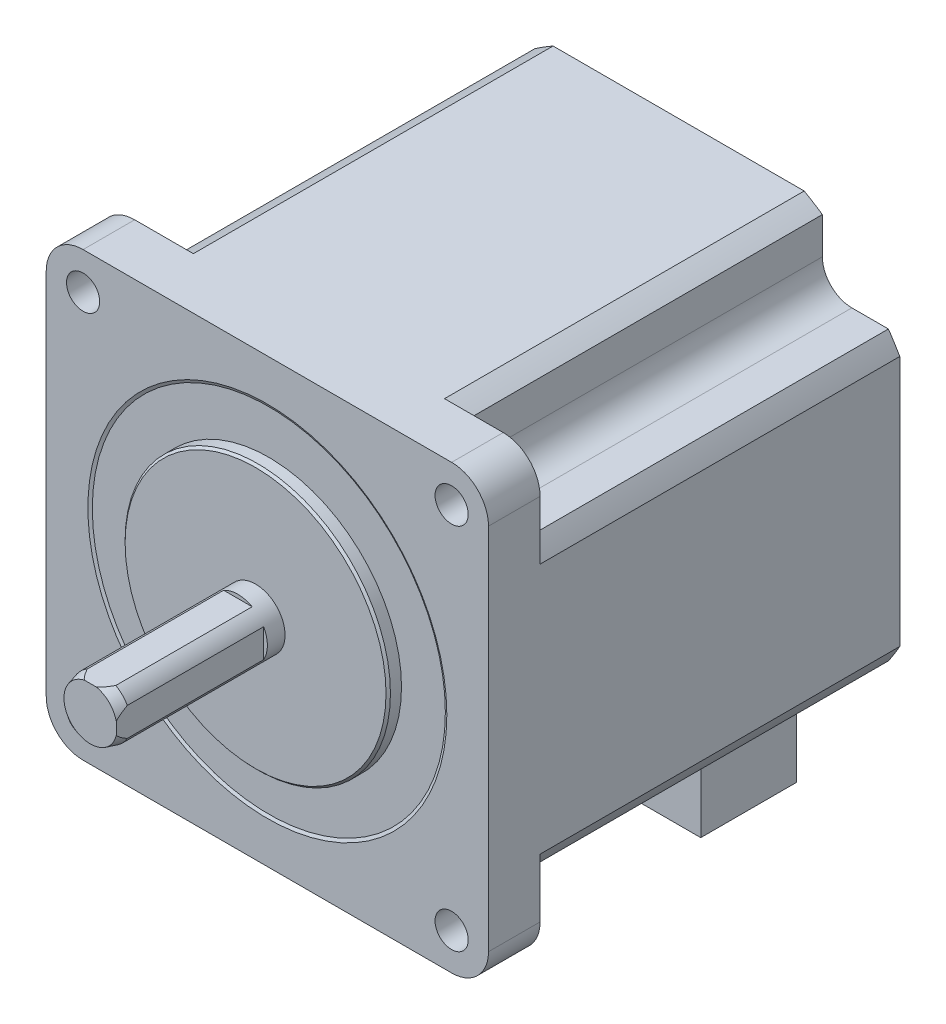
ISO-10303-21;
HEADER;
FILE_DESCRIPTION(('STEP AP214'),'2;1');
FILE_NAME('part.step','',(''),(''),'','','');
FILE_SCHEMA(('AUTOMOTIVE_DESIGN { 1 0 10303 214 1 1 1 1 }'));
ENDSEC;
DATA;
#1=APPLICATION_CONTEXT('core data for automotive mechanical design processes');
#2=APPLICATION_PROTOCOL_DEFINITION('international standard','automotive_design',2000,#1);
#3=PRODUCT_CONTEXT('',#1,'mechanical');
#4=PRODUCT('Part','Part','',(#3));
#5=PRODUCT_RELATED_PRODUCT_CATEGORY('part','',(#4));
#6=PRODUCT_DEFINITION_FORMATION('','',#4);
#7=PRODUCT_DEFINITION_CONTEXT('part definition',#1,'design');
#8=PRODUCT_DEFINITION('design','',#6,#7);
#9=PRODUCT_DEFINITION_SHAPE('','',#8);
#10=(LENGTH_UNIT() NAMED_UNIT(*) SI_UNIT(.MILLI.,.METRE.));
#11=(NAMED_UNIT(*) PLANE_ANGLE_UNIT() SI_UNIT($,.RADIAN.));
#12=(NAMED_UNIT(*) SI_UNIT($,.STERADIAN.) SOLID_ANGLE_UNIT());
#13=UNCERTAINTY_MEASURE_WITH_UNIT(LENGTH_MEASURE(1.E-05),#10,'distance_accuracy_value','');
#14=(GEOMETRIC_REPRESENTATION_CONTEXT(3) GLOBAL_UNCERTAINTY_ASSIGNED_CONTEXT((#13)) GLOBAL_UNIT_ASSIGNED_CONTEXT((#10,
#11,#12)) REPRESENTATION_CONTEXT('',''));
#15=CARTESIAN_POINT('',(0.,0.,0.));
#16=DIRECTION('',(0.,0.,1.));
#17=DIRECTION('',(1.,0.,0.));
#18=AXIS2_PLACEMENT_3D('',#15,#16,#17);
#19=CARTESIAN_POINT('',(0.,0.,22.4));
#20=DIRECTION('',(0.,0.,-1.));
#21=DIRECTION('',(-1.,0.,0.));
#22=AXIS2_PLACEMENT_3D('',#19,#20,#21);
#23=CONICAL_SURFACE('',#22,3.59807621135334,0.261799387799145);
#24=CARTESIAN_POINT('',(3.5,3.65885881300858,16.9316215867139));
#25=CARTESIAN_POINT('',(3.5,3.60239566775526,17.0838864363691));
#26=CARTESIAN_POINT('',(3.5,3.54539058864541,17.2359490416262));
#27=CARTESIAN_POINT('',(3.5,3.43012170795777,17.539604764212));
#28=CARTESIAN_POINT('',(3.5,3.37185784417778,17.6911978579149));
#29=CARTESIAN_POINT('',(3.5,3.19466893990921,18.1458077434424));
#30=CARTESIAN_POINT('',(3.5,3.07358949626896,18.4479953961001));
#31=CARTESIAN_POINT('',(3.5,2.88202757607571,18.9085831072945));
#32=CARTESIAN_POINT('',(3.5,2.81435636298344,19.0681529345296));
#33=CARTESIAN_POINT('',(3.5,2.67631316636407,19.3861181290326));
#34=CARTESIAN_POINT('',(3.5,2.60594127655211,19.5445135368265));
#35=CARTESIAN_POINT('',(3.5,2.46196785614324,19.8596093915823));
#36=CARTESIAN_POINT('',(3.5,2.38837023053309,20.0163116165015));
#37=CARTESIAN_POINT('',(3.5,2.23702965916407,20.3276939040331));
#38=CARTESIAN_POINT('',(3.5,2.15928717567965,20.4823741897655));
#39=CARTESIAN_POINT('',(3.5,1.9995675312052,20.786779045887));
#40=CARTESIAN_POINT('',(3.5,1.91766524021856,20.9365427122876));
#41=CARTESIAN_POINT('',(3.5,1.74677024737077,21.2323903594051));
#42=CARTESIAN_POINT('',(3.5,1.65776561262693,21.3784675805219));
#43=CARTESIAN_POINT('',(3.5,1.51770774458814,21.5916740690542));
#44=CARTESIAN_POINT('',(3.5,1.47033809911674,21.6612195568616));
#45=CARTESIAN_POINT('',(3.5,1.37275172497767,21.7982748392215));
#46=CARTESIAN_POINT('',(3.5,1.32253564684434,21.8657850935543));
#47=CARTESIAN_POINT('',(3.5,1.2187803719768,21.997919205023));
#48=CARTESIAN_POINT('',(3.5,1.16525083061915,22.0625505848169));
#49=CARTESIAN_POINT('',(3.5,1.05398107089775,22.1880495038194));
#50=CARTESIAN_POINT('',(3.5,0.996243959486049,22.2489197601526));
#51=CARTESIAN_POINT('',(3.5,0.879074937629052,22.3618808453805));
#52=CARTESIAN_POINT('',(3.5,0.819941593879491,22.4142773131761));
#53=CARTESIAN_POINT('',(3.5,0.696050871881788,22.5121419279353));
#54=CARTESIAN_POINT('',(3.5,0.631293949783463,22.5576106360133));
#55=CARTESIAN_POINT('',(3.5,0.507273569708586,22.6311614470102));
#56=CARTESIAN_POINT('',(3.5,0.449006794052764,22.6608914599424));
#57=CARTESIAN_POINT('',(3.5,0.328412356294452,22.7105403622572));
#58=CARTESIAN_POINT('',(3.5,0.266093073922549,22.7304788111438));
#59=CARTESIAN_POINT('',(3.5,0.149648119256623,22.7555691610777));
#60=CARTESIAN_POINT('',(3.5,0.0959490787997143,22.7626698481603));
#61=CARTESIAN_POINT('',(3.5,-0.01186972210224,22.7674965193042));
#62=CARTESIAN_POINT('',(3.5,-0.065989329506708,22.7652257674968));
#63=CARTESIAN_POINT('',(3.5,-0.172879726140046,22.7516191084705));
#64=CARTESIAN_POINT('',(3.5,-0.225653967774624,22.7403094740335));
#65=CARTESIAN_POINT('',(3.5,-0.328872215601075,22.7098978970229));
#66=CARTESIAN_POINT('',(3.5,-0.37931467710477,22.6907908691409));
#67=CARTESIAN_POINT('',(3.5,-0.508714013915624,22.6321380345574));
#68=CARTESIAN_POINT('',(3.5,-0.585263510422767,22.587337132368));
#69=CARTESIAN_POINT('',(3.5,-0.730938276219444,22.4869137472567));
#70=CARTESIAN_POINT('',(3.5,-0.800033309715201,22.4312495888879));
#71=CARTESIAN_POINT('',(3.5,-0.955746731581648,22.2916879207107));
#72=CARTESIAN_POINT('',(3.5,-1.03968917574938,22.2048513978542));
#73=CARTESIAN_POINT('',(3.5,-1.19908801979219,22.0236161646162));
#74=CARTESIAN_POINT('',(3.5,-1.27452504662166,21.9292009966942));
#75=CARTESIAN_POINT('',(3.5,-1.41979524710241,21.7344953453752));
#76=CARTESIAN_POINT('',(3.5,-1.48955344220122,21.6341495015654));
#77=CARTESIAN_POINT('',(3.5,-1.62395149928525,21.4302869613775));
#78=CARTESIAN_POINT('',(3.5,-1.68859694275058,21.3267738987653));
#79=CARTESIAN_POINT('',(3.5,-1.85613404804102,21.0470251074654));
#80=CARTESIAN_POINT('',(3.5,-1.95551266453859,20.8686941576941));
#81=CARTESIAN_POINT('',(3.5,-2.14665533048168,20.5079710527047));
#82=CARTESIAN_POINT('',(3.5,-2.23841606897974,20.3255771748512));
#83=CARTESIAN_POINT('',(3.5,-2.41645935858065,19.9576498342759));
#84=CARTESIAN_POINT('',(3.5,-2.50272932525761,19.7721103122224));
#85=CARTESIAN_POINT('',(3.5,-2.67090131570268,19.3990599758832));
#86=CARTESIAN_POINT('',(3.5,-2.7528030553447,19.2115490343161));
#87=CARTESIAN_POINT('',(3.5,-2.90658898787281,18.8504519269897));
#88=CARTESIAN_POINT('',(3.5,-2.97874468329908,18.6769809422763));
#89=CARTESIAN_POINT('',(3.5,-3.12065566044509,18.3290502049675));
#90=CARTESIAN_POINT('',(3.5,-3.19041080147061,18.1545903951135));
#91=CARTESIAN_POINT('',(3.5,-3.32757858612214,17.8057332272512));
#92=CARTESIAN_POINT('',(3.5,-3.39500096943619,17.6313396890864));
#93=CARTESIAN_POINT('',(3.5,-3.52813716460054,17.2819241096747));
#94=CARTESIAN_POINT('',(3.5,-3.59385117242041,17.1069021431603));
#95=CARTESIAN_POINT('',(3.5,-3.65885881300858,16.9316215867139));
#96=B_SPLINE_CURVE_WITH_KNOTS('',3,(#24,#25,#26,#27,#28,#29,#30,#31,#32,#33,#34,#35,#36,#37,#38,
#39,#40,#41,#42,#43,#44,#45,#46,#47,#48,#49,#50,#51,#52,#53,#54,#55,#56,#57,#58,#59,#60,#61,#62,
#63,#64,#65,#66,#67,#68,#69,#70,#71,#72,#73,#74,#75,#76,#77,#78,#79,#80,#81,#82,#83,#84,#85,#86,
#87,#88,#89,#90,#91,#92,#93,#94,#95),.UNSPECIFIED.,.F.,.F.,(4,2,2,2,2,2,2,2,2,2,2,2,2,2,2,2,2,2,
2,2,2,2,2,2,2,2,2,2,2,2,2,2,2,2,2,4),(0.,0.487185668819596,0.974395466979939,1.95092394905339,
2.47088362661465,2.99082527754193,3.51015400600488,4.0294249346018,4.54139798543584,
5.0542501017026,5.30663191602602,5.55895628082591,5.81057715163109,6.0620140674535,
6.29868754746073,6.53534184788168,6.73093008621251,6.9261260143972,7.08786234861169,
7.24954235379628,7.4107541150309,7.5720711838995,7.83661046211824,8.10218530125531,
8.46361083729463,8.82584364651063,9.19226963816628,9.55828992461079,10.1704387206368,
10.7828521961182,11.3966221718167,12.0104320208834,12.574048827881,13.1376986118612,
13.6986081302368,14.2594530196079),.UNSPECIFIED.);
#97=CARTESIAN_POINT('',(3.5,1.93649167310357,20.9000000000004));
#98=VERTEX_POINT('',#97);
#99=CARTESIAN_POINT('',(3.5,0.834357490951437,22.4));
#100=VERTEX_POINT('',#99);
#101=EDGE_CURVE('E307',#98,#100,#96,.T.);
#102=ORIENTED_EDGE('',*,*,#101,.F.);
#103=CARTESIAN_POINT('',(0.,0.,20.9));
#104=DIRECTION('',(0.,0.,1.));
#105=DIRECTION('',(1.,0.,0.));
#106=AXIS2_PLACEMENT_3D('',#103,#104,#105);
#107=CIRCLE('',#106,4.);
#108=CARTESIAN_POINT('',(1.93649167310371,3.5,20.9));
#109=VERTEX_POINT('',#108);
#110=EDGE_CURVE('E334',#109,#98,#107,.F.);
#111=ORIENTED_EDGE('',*,*,#110,.F.);
#112=CARTESIAN_POINT('',(-3.86930929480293,3.5,16.3564970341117));
#113=CARTESIAN_POINT('',(-3.81130684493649,3.5,16.5170199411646));
#114=CARTESIAN_POINT('',(-3.75279353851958,3.5,16.6773588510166));
#115=CARTESIAN_POINT('',(-3.6345807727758,3.5,16.9976052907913));
#116=CARTESIAN_POINT('',(-3.57488126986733,3.5,17.1575128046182));
#117=CARTESIAN_POINT('',(-3.39361030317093,3.5,17.6368798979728));
#118=CARTESIAN_POINT('',(-3.27001249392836,3.5,17.9555770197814));
#119=CARTESIAN_POINT('',(-3.0124423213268,3.5,18.5978750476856));
#120=CARTESIAN_POINT('',(-2.87828989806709,3.5,18.9214046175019));
#121=CARTESIAN_POINT('',(-2.66885480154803,3.5,19.4030223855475));
#122=CARTESIAN_POINT('',(-2.59769761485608,3.5,19.5629021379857));
#123=CARTESIAN_POINT('',(-2.45197127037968,3.5,19.8810939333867));
#124=CARTESIAN_POINT('',(-2.37740232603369,3.5,20.0394060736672));
#125=CARTESIAN_POINT('',(-2.2244181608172,3.5,20.3530265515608));
#126=CARTESIAN_POINT('',(-2.14602805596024,3.5,20.5083470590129));
#127=CARTESIAN_POINT('',(-1.98368792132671,3.5,20.816207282));
#128=CARTESIAN_POINT('',(-1.89973412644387,3.5,20.9687450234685));
#129=CARTESIAN_POINT('',(-1.72475802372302,3.5,21.2690282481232));
#130=CARTESIAN_POINT('',(-1.63376343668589,3.5,21.4167895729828));
#131=CARTESIAN_POINT('',(-1.48957033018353,3.5,21.6332031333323));
#132=CARTESIAN_POINT('',(-1.44025385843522,3.5,21.704429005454));
#133=CARTESIAN_POINT('',(-1.33846826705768,3.5,21.8445807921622));
#134=CARTESIAN_POINT('',(-1.28599919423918,3.5,21.913506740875));
#135=CARTESIAN_POINT('',(-1.15028154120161,3.5,22.0816859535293));
#136=CARTESIAN_POINT('',(-1.06463830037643,3.5,22.1790896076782));
#137=CARTESIAN_POINT('',(-0.927427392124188,3.5,22.3162128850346));
#138=CARTESIAN_POINT('',(-0.880306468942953,3.5,22.3603667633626));
#139=CARTESIAN_POINT('',(-0.782611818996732,3.5,22.4446415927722));
#140=CARTESIAN_POINT('',(-0.732041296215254,3.5,22.4847662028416));
#141=CARTESIAN_POINT('',(-0.626326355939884,3.5,22.5599557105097));
#142=CARTESIAN_POINT('',(-0.571136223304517,3.5,22.5949574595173));
#143=CARTESIAN_POINT('',(-0.456439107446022,3.5,22.6571140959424));
#144=CARTESIAN_POINT('',(-0.396936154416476,3.5,22.684276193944));
#145=CARTESIAN_POINT('',(-0.282931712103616,3.5,22.7248685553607));
#146=CARTESIAN_POINT('',(-0.228944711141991,3.5,22.7397133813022));
#147=CARTESIAN_POINT('',(-0.119250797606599,3.5,22.7600378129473));
#148=CARTESIAN_POINT('',(-0.0635463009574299,3.5,22.7655300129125));
#149=CARTESIAN_POINT('',(0.048071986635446,3.5,22.7664569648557));
#150=CARTESIAN_POINT('',(0.103985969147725,3.5,22.7618697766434));
#151=CARTESIAN_POINT('',(0.214216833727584,3.5,22.7432034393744));
#152=CARTESIAN_POINT('',(0.268531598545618,3.5,22.7291122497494));
#153=CARTESIAN_POINT('',(0.392914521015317,3.5,22.6866590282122));
#154=CARTESIAN_POINT('',(0.4618486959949,3.5,22.6550295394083));
#155=CARTESIAN_POINT('',(0.593979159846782,3.5,22.5815220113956));
#156=CARTESIAN_POINT('',(0.657160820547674,3.5,22.5396187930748));
#157=CARTESIAN_POINT('',(0.775505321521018,3.5,22.4508929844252));
#158=CARTESIAN_POINT('',(0.830900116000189,3.5,22.4043731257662));
#159=CARTESIAN_POINT('',(0.937609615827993,3.5,22.3068263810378));
#160=CARTESIAN_POINT('',(0.988920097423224,3.5,22.2557949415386));
#161=CARTESIAN_POINT('',(1.08824660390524,3.5,22.1503476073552));
#162=CARTESIAN_POINT('',(1.13625167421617,3.5,22.0959215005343));
#163=CARTESIAN_POINT('',(1.22933749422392,3.5,21.9846920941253));
#164=CARTESIAN_POINT('',(1.27441975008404,3.5,21.9278900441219));
#165=CARTESIAN_POINT('',(1.40470096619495,3.5,21.7565363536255));
#166=CARTESIAN_POINT('',(1.48644178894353,3.5,21.6393610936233));
#167=CARTESIAN_POINT('',(1.6431920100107,3.5,21.4005598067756));
#168=CARTESIAN_POINT('',(1.7181962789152,3.5,21.2789304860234));
#169=CARTESIAN_POINT('',(1.86323185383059,3.5,21.0323940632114));
#170=CARTESIAN_POINT('',(1.93325170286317,3.5,20.9074802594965));
#171=CARTESIAN_POINT('',(2.06928175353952,3.5,20.6554785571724));
#172=CARTESIAN_POINT('',(2.13529130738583,3.5,20.5283903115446));
#173=CARTESIAN_POINT('',(2.2644211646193,3.5,20.2719514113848));
#174=CARTESIAN_POINT('',(2.32752509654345,3.5,20.1425925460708));
#175=CARTESIAN_POINT('',(2.4510774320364,3.5,19.8826099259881));
#176=CARTESIAN_POINT('',(2.51152569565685,3.5,19.7519861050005));
#177=CARTESIAN_POINT('',(2.68941804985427,3.5,19.3589924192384));
#178=CARTESIAN_POINT('',(2.80358743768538,3.5,19.0951401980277));
#179=CARTESIAN_POINT('',(3.00048591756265,3.5,18.6248626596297));
#180=CARTESIAN_POINT('',(3.08448097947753,3.5,18.418960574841));
#181=CARTESIAN_POINT('',(3.24945704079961,3.5,18.0058641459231));
#182=CARTESIAN_POINT('',(3.33043691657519,3.5,17.798669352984));
#183=CARTESIAN_POINT('',(3.48887984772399,3.5,17.3860176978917));
#184=CARTESIAN_POINT('',(3.56637485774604,3.5,17.1805730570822));
#185=CARTESIAN_POINT('',(3.71929183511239,3.5,16.7690161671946));
#186=CARTESIAN_POINT('',(3.79471470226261,3.5,16.5629042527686));
#187=CARTESIAN_POINT('',(3.86930929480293,3.5,16.3564970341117));
#188=B_SPLINE_CURVE_WITH_KNOTS('',3,(#112,#113,#114,#115,#116,#117,#118,#119,#120,#121,#122,
#123,#124,#125,#126,#127,#128,#129,#130,#131,#132,#133,#134,#135,#136,#137,#138,#139,#140,#141,
#142,#143,#144,#145,#146,#147,#148,#149,#150,#151,#152,#153,#154,#155,#156,#157,#158,#159,#160,
#161,#162,#163,#164,#165,#166,#167,#168,#169,#170,#171,#172,#173,#174,#175,#176,#177,#178,#179,
#180,#181,#182,#183,#184,#185,#186,#187),.UNSPECIFIED.,.F.,.F.,(4,2,2,2,2,2,2,2,2,2,2,2,2,2,2,2,
2,2,2,2,2,2,2,2,2,2,2,2,2,2,2,2,2,2,2,2,2,4),(0.,0.512041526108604,1.02410189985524,
2.04951981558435,3.10007779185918,3.62504636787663,4.14998214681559,4.67184000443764,
5.19405469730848,5.71430882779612,5.9741287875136,6.2339448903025,6.62218502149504,
6.81575137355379,7.0091403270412,7.20474211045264,7.40016340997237,7.56743042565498,
7.73447202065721,7.90187758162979,8.06949562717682,8.29573563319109,8.52253575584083,
8.73922123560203,8.95612796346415,9.1737220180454,9.39120303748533,9.81942658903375,
10.247973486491,10.6774755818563,11.1070468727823,11.5387992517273,11.9705743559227,
12.8329204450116,13.500025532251,14.1673767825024,14.8260894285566,15.4845113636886),.UNSPECIFIED.);
#189=CARTESIAN_POINT('',(0.834357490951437,3.5,22.4));
#190=VERTEX_POINT('',#189);
#191=EDGE_CURVE('E326',#190,#109,#188,.T.);
#192=ORIENTED_EDGE('',*,*,#191,.F.);
#193=CARTESIAN_POINT('',(0.,0.,22.4));
#194=DIRECTION('',(0.,0.,1.));
#195=DIRECTION('',(1.,0.,0.));
#196=AXIS2_PLACEMENT_3D('',#193,#194,#195);
#197=CIRCLE('',#196,3.59807621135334);
#198=EDGE_CURVE('E61',#100,#190,#197,.T.);
#199=ORIENTED_EDGE('',*,*,#198,.F.);
#200=EDGE_LOOP('',(#102,#111,#192,#199));
#201=FACE_BOUND('',#200,.T.);
#202=ADVANCED_FACE('F39',(#201),#23,.T.);
#203=CARTESIAN_POINT('',(0.,0.,22.4));
#204=DIRECTION('',(0.,0.,-1.));
#205=DIRECTION('',(-1.,0.,0.));
#206=AXIS2_PLACEMENT_3D('',#203,#204,#205);
#207=CYLINDRICAL_SURFACE('',#206,4.);
#208=ORIENTED_EDGE('',*,*,#110,.T.);
#209=DIRECTION('',(0.,0.,-1.));
#210=VECTOR('',#209,1.);
#211=CARTESIAN_POINT('',(3.5,1.93649167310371,22.4));
#212=LINE('',#211,#210);
#213=CARTESIAN_POINT('',(3.5,1.93649167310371,2.4));
#214=VERTEX_POINT('',#213);
#215=EDGE_CURVE('E311',#98,#214,#212,.T.);
#216=ORIENTED_EDGE('',*,*,#215,.T.);
#217=CARTESIAN_POINT('',(0.,0.,2.4));
#218=DIRECTION('',(0.,0.,-1.));
#219=DIRECTION('',(-1.,0.,0.));
#220=AXIS2_PLACEMENT_3D('',#217,#218,#219);
#221=CIRCLE('',#220,4.);
#222=CARTESIAN_POINT('',(3.5,-1.93649167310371,2.4));
#223=VERTEX_POINT('',#222);
#224=EDGE_CURVE('E315',#214,#223,#221,.T.);
#225=ORIENTED_EDGE('',*,*,#224,.T.);
#226=DIRECTION('',(0.,0.,-1.));
#227=VECTOR('',#226,1.);
#228=CARTESIAN_POINT('',(3.5,-1.93649167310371,22.4));
#229=LINE('',#228,#227);
#230=CARTESIAN_POINT('',(3.5,-1.93649167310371,20.9));
#231=VERTEX_POINT('',#230);
#232=EDGE_CURVE('E549',#223,#231,#229,.F.);
#233=ORIENTED_EDGE('',*,*,#232,.T.);
#234=CARTESIAN_POINT('',(-1.93649167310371,3.5,20.9));
#235=VERTEX_POINT('',#234);
#236=EDGE_CURVE('E329',#231,#235,#107,.F.);
#237=ORIENTED_EDGE('',*,*,#236,.T.);
#238=DIRECTION('',(0.,0.,-1.));
#239=VECTOR('',#238,1.);
#240=CARTESIAN_POINT('',(-1.93649167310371,3.5,22.4));
#241=LINE('',#240,#239);
#242=CARTESIAN_POINT('',(-1.93649167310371,3.5,2.4));
#243=VERTEX_POINT('',#242);
#244=EDGE_CURVE('E561',#235,#243,#241,.T.);
#245=ORIENTED_EDGE('',*,*,#244,.T.);
#246=CARTESIAN_POINT('',(0.,0.,2.4));
#247=DIRECTION('',(0.,0.,1.));
#248=DIRECTION('',(1.,0.,0.));
#249=AXIS2_PLACEMENT_3D('',#246,#247,#248);
#250=CIRCLE('',#249,4.);
#251=CARTESIAN_POINT('',(1.93649167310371,3.5,2.4));
#252=VERTEX_POINT('',#251);
#253=EDGE_CURVE('E343',#252,#243,#250,.T.);
#254=ORIENTED_EDGE('',*,*,#253,.F.);
#255=DIRECTION('',(0.,0.,-1.));
#256=VECTOR('',#255,1.);
#257=CARTESIAN_POINT('',(1.93649167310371,3.5,22.4));
#258=LINE('',#257,#256);
#259=EDGE_CURVE('E557',#252,#109,#258,.F.);
#260=ORIENTED_EDGE('',*,*,#259,.T.);
#261=EDGE_LOOP('',(#208,#216,#225,#233,#237,#245,#254,#260));
#262=FACE_BOUND('',#261,.T.);
#263=CARTESIAN_POINT('',(0.,0.,0.));
#264=DIRECTION('',(0.,0.,-1.));
#265=DIRECTION('',(-1.,0.,0.));
#266=AXIS2_PLACEMENT_3D('',#263,#264,#265);
#267=CIRCLE('',#266,4.);
#268=CARTESIAN_POINT('',(-4.,0.,0.));
#269=VERTEX_POINT('',#268);
#270=EDGE_CURVE('E787',#269,#269,#267,.T.);
#271=ORIENTED_EDGE('',*,*,#270,.F.);
#272=EDGE_LOOP('',(#271));
#273=FACE_BOUND('',#272,.T.);
#274=ADVANCED_FACE('F479',(#262,#273),#207,.T.);
#275=CARTESIAN_POINT('',(0.,0.,22.4));
#276=DIRECTION('',(0.,0.,1.));
#277=DIRECTION('',(1.,0.,0.));
#278=AXIS2_PLACEMENT_3D('',#275,#276,#277);
#279=PLANE('',#278);
#280=DIRECTION('',(0.,-1.,0.));
#281=VECTOR('',#280,1.);
#282=CARTESIAN_POINT('',(3.5,2.44128177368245,22.4));
#283=LINE('',#282,#281);
#284=CARTESIAN_POINT('',(3.5,-0.834357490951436,22.4));
#285=VERTEX_POINT('',#284);
#286=EDGE_CURVE('E54',#100,#285,#283,.T.);
#287=ORIENTED_EDGE('',*,*,#286,.F.);
#288=ORIENTED_EDGE('',*,*,#198,.T.);
#289=DIRECTION('',(1.,0.,0.));
#290=VECTOR('',#289,1.);
#291=CARTESIAN_POINT('',(-4.72781232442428,3.5,22.4));
#292=LINE('',#291,#290);
#293=CARTESIAN_POINT('',(-0.834357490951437,3.5,22.4));
#294=VERTEX_POINT('',#293);
#295=EDGE_CURVE('E553',#294,#190,#292,.T.);
#296=ORIENTED_EDGE('',*,*,#295,.F.);
#297=EDGE_CURVE('E321',#294,#285,#197,.T.);
#298=ORIENTED_EDGE('',*,*,#297,.T.);
#299=EDGE_LOOP('',(#287,#288,#296,#298));
#300=FACE_BOUND('',#299,.T.);
#301=ADVANCED_FACE('F319',(#300),#279,.T.);
#302=CARTESIAN_POINT('',(0.,0.,0.));
#303=DIRECTION('',(0.,0.,-1.));
#304=DIRECTION('',(-1.,0.,0.));
#305=AXIS2_PLACEMENT_3D('',#302,#303,#304);
#306=PLANE('',#305);
#307=CARTESIAN_POINT('',(0.,0.,0.));
#308=DIRECTION('',(0.,0.,-1.));
#309=DIRECTION('',(-1.,0.,0.));
#310=AXIS2_PLACEMENT_3D('',#307,#308,#309);
#311=CIRCLE('',#310,17.7);
#312=CARTESIAN_POINT('',(-17.7,0.,0.));
#313=VERTEX_POINT('',#312);
#314=EDGE_CURVE('E47',#313,#313,#311,.F.);
#315=ORIENTED_EDGE('',*,*,#314,.T.);
#316=EDGE_LOOP('',(#315));
#317=FACE_BOUND('',#316,.T.);
#318=ORIENTED_EDGE('',*,*,#270,.T.);
#319=EDGE_LOOP('',(#318));
#320=FACE_BOUND('',#319,.T.);
#321=ADVANCED_FACE('F469',(#317,#320),#306,.F.);
#322=CARTESIAN_POINT('',(0.,0.,-1.6));
#323=DIRECTION('',(0.,0.,1.));
#324=DIRECTION('',(1.,0.,0.));
#325=AXIS2_PLACEMENT_3D('',#322,#323,#324);
#326=CYLINDRICAL_SURFACE('',#325,18.);
#327=CARTESIAN_POINT('',(0.,0.,-0.300000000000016));
#328=DIRECTION('',(0.,0.,-1.));
#329=DIRECTION('',(-1.,0.,0.));
#330=AXIS2_PLACEMENT_3D('',#327,#328,#329);
#331=CIRCLE('',#330,18.);
#332=CARTESIAN_POINT('',(-18.,0.,-0.300000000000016));
#333=VERTEX_POINT('',#332);
#334=EDGE_CURVE('E1386',#333,#333,#331,.T.);
#335=ORIENTED_EDGE('',*,*,#334,.T.);
#336=EDGE_LOOP('',(#335));
#337=FACE_BOUND('',#336,.T.);
#338=CARTESIAN_POINT('',(0.,0.,-1.8));
#339=DIRECTION('',(0.,0.,1.));
#340=DIRECTION('',(1.,0.,0.));
#341=AXIS2_PLACEMENT_3D('',#338,#339,#340);
#342=CIRCLE('',#341,18.);
#343=CARTESIAN_POINT('',(18.,0.,-1.8));
#344=VERTEX_POINT('',#343);
#345=EDGE_CURVE('E542',#344,#344,#342,.T.);
#346=ORIENTED_EDGE('',*,*,#345,.T.);
#347=EDGE_LOOP('',(#346));
#348=FACE_BOUND('',#347,.T.);
#349=ADVANCED_FACE('F472',(#337,#348),#326,.T.);
#350=EDGE_CURVE('E316',#285,#231,#96,.T.);
#351=ORIENTED_EDGE('',*,*,#350,.F.);
#352=ORIENTED_EDGE('',*,*,#297,.F.);
#353=EDGE_CURVE('E342',#235,#294,#188,.T.);
#354=ORIENTED_EDGE('',*,*,#353,.F.);
#355=ORIENTED_EDGE('',*,*,#236,.F.);
#356=EDGE_LOOP('',(#351,#352,#354,#355));
#357=FACE_BOUND('',#356,.T.);
#358=ADVANCED_FACE('F344',(#357),#23,.T.);
#359=CARTESIAN_POINT('',(0.,0.,2.4));
#360=DIRECTION('',(0.,0.,1.));
#361=DIRECTION('',(1.,0.,0.));
#362=AXIS2_PLACEMENT_3D('',#359,#360,#361);
#363=PLANE('',#362);
#364=ORIENTED_EDGE('',*,*,#253,.T.);
#365=DIRECTION('',(1.,0.,0.));
#366=VECTOR('',#365,1.);
#367=CARTESIAN_POINT('',(-4.72781232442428,3.5,2.4));
#368=LINE('',#367,#366);
#369=EDGE_CURVE('E554',#243,#252,#368,.T.);
#370=ORIENTED_EDGE('',*,*,#369,.T.);
#371=EDGE_LOOP('',(#364,#370));
#372=FACE_BOUND('',#371,.T.);
#373=ADVANCED_FACE('F353',(#372),#363,.T.);
#374=CARTESIAN_POINT('',(-4.72781232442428,3.5,2.4));
#375=DIRECTION('',(0.,-1.,0.));
#376=DIRECTION('',(0.,0.,-1.));
#377=AXIS2_PLACEMENT_3D('',#374,#375,#376);
#378=PLANE('',#377);
#379=ORIENTED_EDGE('',*,*,#353,.T.);
#380=ORIENTED_EDGE('',*,*,#295,.T.);
#381=ORIENTED_EDGE('',*,*,#191,.T.);
#382=ORIENTED_EDGE('',*,*,#259,.F.);
#383=ORIENTED_EDGE('',*,*,#369,.F.);
#384=ORIENTED_EDGE('',*,*,#244,.F.);
#385=EDGE_LOOP('',(#379,#380,#381,#382,#383,#384));
#386=FACE_BOUND('',#385,.T.);
#387=ADVANCED_FACE('F347',(#386),#378,.F.);
#388=CARTESIAN_POINT('',(0.,0.,2.4));
#389=DIRECTION('',(0.,0.,-1.));
#390=DIRECTION('',(-1.,0.,0.));
#391=AXIS2_PLACEMENT_3D('',#388,#389,#390);
#392=PLANE('',#391);
#393=DIRECTION('',(0.,-1.,0.));
#394=VECTOR('',#393,1.);
#395=CARTESIAN_POINT('',(3.5,2.44128177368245,2.4));
#396=LINE('',#395,#394);
#397=EDGE_CURVE('E322',#214,#223,#396,.T.);
#398=ORIENTED_EDGE('',*,*,#397,.T.);
#399=ORIENTED_EDGE('',*,*,#224,.F.);
#400=EDGE_LOOP('',(#398,#399));
#401=FACE_BOUND('',#400,.T.);
#402=ADVANCED_FACE('F352',(#401),#392,.F.);
#403=CARTESIAN_POINT('',(3.5,2.44128177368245,2.4));
#404=DIRECTION('',(-1.,0.,0.));
#405=DIRECTION('',(0.,-1.,0.));
#406=AXIS2_PLACEMENT_3D('',#403,#404,#405);
#407=PLANE('',#406);
#408=ORIENTED_EDGE('',*,*,#101,.T.);
#409=ORIENTED_EDGE('',*,*,#286,.T.);
#410=ORIENTED_EDGE('',*,*,#350,.T.);
#411=ORIENTED_EDGE('',*,*,#232,.F.);
#412=ORIENTED_EDGE('',*,*,#397,.F.);
#413=ORIENTED_EDGE('',*,*,#215,.F.);
#414=EDGE_LOOP('',(#408,#409,#410,#411,#412,#413));
#415=FACE_BOUND('',#414,.T.);
#416=ADVANCED_FACE('F308',(#415),#407,.F.);
#417=CARTESIAN_POINT('',(0.,0.,-0.300000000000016));
#418=DIRECTION('',(0.,0.,-1.));
#419=DIRECTION('',(-1.,0.,0.));
#420=AXIS2_PLACEMENT_3D('',#417,#418,#419);
#421=CONICAL_SURFACE('',#420,18.,0.785398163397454);
#422=ORIENTED_EDGE('',*,*,#314,.F.);
#423=EDGE_LOOP('',(#422));
#424=FACE_BOUND('',#423,.T.);
#425=ORIENTED_EDGE('',*,*,#334,.F.);
#426=EDGE_LOOP('',(#425));
#427=FACE_BOUND('',#426,.T.);
#428=ADVANCED_FACE('F528',(#424,#427),#421,.T.);
#429=CARTESIAN_POINT('',(0.,0.,-1.8));
#430=DIRECTION('',(0.,0.,1.));
#431=DIRECTION('',(1.,0.,0.));
#432=AXIS2_PLACEMENT_3D('',#429,#430,#431);
#433=PLANE('',#432);
#434=CARTESIAN_POINT('',(0.,0.,-1.8));
#435=DIRECTION('',(0.,0.,1.));
#436=DIRECTION('',(1.,0.,0.));
#437=AXIS2_PLACEMENT_3D('',#434,#435,#436);
#438=CIRCLE('',#437,23.95);
#439=CARTESIAN_POINT('',(23.95,0.,-1.8));
#440=VERTEX_POINT('',#439);
#441=EDGE_CURVE('E11',#440,#440,#438,.T.);
#442=ORIENTED_EDGE('',*,*,#441,.T.);
#443=EDGE_LOOP('',(#442));
#444=FACE_BOUND('',#443,.T.);
#445=ORIENTED_EDGE('',*,*,#345,.F.);
#446=EDGE_LOOP('',(#445));
#447=FACE_BOUND('',#446,.T.);
#448=ADVANCED_FACE('F391',(#444,#447),#433,.T.);
#449=CARTESIAN_POINT('',(0.,-19.4999999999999,-57.4));
#450=DIRECTION('',(0.,1.,0.));
#451=DIRECTION('',(-1.,0.,0.));
#452=AXIS2_PLACEMENT_3D('',#449,#450,#451);
#453=PLANE('',#452);
#454=DIRECTION('',(-1.,0.,0.));
#455=VECTOR('',#454,1.);
#456=CARTESIAN_POINT('',(0.,-19.4999999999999,-57.4));
#457=LINE('',#456,#455);
#458=CARTESIAN_POINT('',(-23.5,-19.5,-57.4));
#459=VERTEX_POINT('',#458);
#460=CARTESIAN_POINT('',(-28.4604989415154,-19.5,-57.4));
#461=VERTEX_POINT('',#460);
#462=EDGE_CURVE('E631',#459,#461,#457,.T.);
#463=ORIENTED_EDGE('',*,*,#462,.F.);
#464=DIRECTION('',(0.,0.,1.));
#465=VECTOR('',#464,1.);
#466=CARTESIAN_POINT('',(-23.5,-19.5,-57.4));
#467=LINE('',#466,#465);
#468=CARTESIAN_POINT('',(-23.5,-19.5,-8.6));
#469=VERTEX_POINT('',#468);
#470=EDGE_CURVE('E697',#459,#469,#467,.T.);
#471=ORIENTED_EDGE('',*,*,#470,.T.);
#472=DIRECTION('',(-1.,0.,0.));
#473=VECTOR('',#472,1.);
#474=CARTESIAN_POINT('',(0.,-19.4999999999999,-8.6));
#475=LINE('',#474,#473);
#476=CARTESIAN_POINT('',(-28.4604989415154,-19.5,-8.6));
#477=VERTEX_POINT('',#476);
#478=EDGE_CURVE('E871',#469,#477,#475,.T.);
#479=ORIENTED_EDGE('',*,*,#478,.T.);
#480=DIRECTION('',(0.,0.,1.));
#481=VECTOR('',#480,1.);
#482=CARTESIAN_POINT('',(-28.4604989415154,-19.5,-57.4));
#483=LINE('',#482,#481);
#484=EDGE_CURVE('E873',#461,#477,#483,.T.);
#485=ORIENTED_EDGE('',*,*,#484,.F.);
#486=EDGE_LOOP('',(#463,#471,#479,#485));
#487=FACE_BOUND('',#486,.T.);
#488=ADVANCED_FACE('F387',(#487),#453,.F.);
#489=CARTESIAN_POINT('',(-23.5,-23.5,-57.4));
#490=DIRECTION('',(0.,0.,1.));
#491=DIRECTION('',(1.,0.,0.));
#492=AXIS2_PLACEMENT_3D('',#489,#490,#491);
#493=CYLINDRICAL_SURFACE('',#492,4.);
#494=CARTESIAN_POINT('',(-23.5,-23.5,-57.4));
#495=DIRECTION('',(0.,0.,-1.));
#496=DIRECTION('',(-1.,0.,0.));
#497=AXIS2_PLACEMENT_3D('',#494,#495,#496);
#498=CIRCLE('',#497,4.);
#499=CARTESIAN_POINT('',(-19.5,-23.5,-57.4));
#500=VERTEX_POINT('',#499);
#501=EDGE_CURVE('E720',#500,#459,#498,.F.);
#502=ORIENTED_EDGE('',*,*,#501,.F.);
#503=DIRECTION('',(0.,0.,1.));
#504=VECTOR('',#503,1.);
#505=CARTESIAN_POINT('',(-19.5,-23.5,-57.4));
#506=LINE('',#505,#504);
#507=CARTESIAN_POINT('',(-19.5,-23.5,-8.6));
#508=VERTEX_POINT('',#507);
#509=EDGE_CURVE('E702',#508,#500,#506,.F.);
#510=ORIENTED_EDGE('',*,*,#509,.F.);
#511=CARTESIAN_POINT('',(-23.5,-23.5,-8.6));
#512=DIRECTION('',(0.,0.,-1.));
#513=DIRECTION('',(-1.,0.,0.));
#514=AXIS2_PLACEMENT_3D('',#511,#512,#513);
#515=CIRCLE('',#514,4.);
#516=EDGE_CURVE('E700',#469,#508,#515,.T.);
#517=ORIENTED_EDGE('',*,*,#516,.F.);
#518=ORIENTED_EDGE('',*,*,#470,.F.);
#519=EDGE_LOOP('',(#502,#510,#517,#518));
#520=FACE_BOUND('',#519,.T.);
#521=ADVANCED_FACE('F390',(#520),#493,.F.);
#522=CARTESIAN_POINT('',(-19.5,0.,-57.4));
#523=DIRECTION('',(-1.,0.,0.));
#524=DIRECTION('',(0.,-1.,0.));
#525=AXIS2_PLACEMENT_3D('',#522,#523,#524);
#526=PLANE('',#525);
#527=DIRECTION('',(0.,-1.,0.));
#528=VECTOR('',#527,1.);
#529=CARTESIAN_POINT('',(-19.5,0.,-8.6));
#530=LINE('',#529,#528);
#531=CARTESIAN_POINT('',(-19.5,-28.4604989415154,-8.6));
#532=VERTEX_POINT('',#531);
#533=EDGE_CURVE('E869',#508,#532,#530,.T.);
#534=ORIENTED_EDGE('',*,*,#533,.F.);
#535=ORIENTED_EDGE('',*,*,#509,.T.);
#536=DIRECTION('',(0.,-1.,0.));
#537=VECTOR('',#536,1.);
#538=CARTESIAN_POINT('',(-19.5,0.,-57.4));
#539=LINE('',#538,#537);
#540=CARTESIAN_POINT('',(-19.5,-28.4604989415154,-57.4));
#541=VERTEX_POINT('',#540);
#542=EDGE_CURVE('E629',#500,#541,#539,.T.);
#543=ORIENTED_EDGE('',*,*,#542,.T.);
#544=DIRECTION('',(0.,0.,1.));
#545=VECTOR('',#544,1.);
#546=CARTESIAN_POINT('',(-19.5,-28.4604989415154,-57.4));
#547=LINE('',#546,#545);
#548=EDGE_CURVE('E876',#541,#532,#547,.T.);
#549=ORIENTED_EDGE('',*,*,#548,.T.);
#550=EDGE_LOOP('',(#534,#535,#543,#549));
#551=FACE_BOUND('',#550,.T.);
#552=ADVANCED_FACE('F393',(#551),#526,.T.);
#553=CARTESIAN_POINT('',(-19.5,0.,-57.4));
#554=DIRECTION('',(-1.,0.,0.));
#555=DIRECTION('',(0.,-1.,0.));
#556=AXIS2_PLACEMENT_3D('',#553,#554,#555);
#557=PLANE('',#556);
#558=DIRECTION('',(0.,-1.,0.));
#559=VECTOR('',#558,1.);
#560=CARTESIAN_POINT('',(-19.5,0.,-57.4));
#561=LINE('',#560,#559);
#562=CARTESIAN_POINT('',(-19.5,28.4604989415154,-57.4));
#563=VERTEX_POINT('',#562);
#564=CARTESIAN_POINT('',(-19.5,23.5,-57.4));
#565=VERTEX_POINT('',#564);
#566=EDGE_CURVE('E602',#563,#565,#561,.T.);
#567=ORIENTED_EDGE('',*,*,#566,.T.);
#568=DIRECTION('',(0.,0.,1.));
#569=VECTOR('',#568,1.);
#570=CARTESIAN_POINT('',(-19.5,23.5,-8.6));
#571=LINE('',#570,#569);
#572=CARTESIAN_POINT('',(-19.5,23.5,-8.6));
#573=VERTEX_POINT('',#572);
#574=EDGE_CURVE('E704',#565,#573,#571,.T.);
#575=ORIENTED_EDGE('',*,*,#574,.T.);
#576=DIRECTION('',(0.,-1.,0.));
#577=VECTOR('',#576,1.);
#578=CARTESIAN_POINT('',(-19.5,0.,-8.6));
#579=LINE('',#578,#577);
#580=CARTESIAN_POINT('',(-19.5,28.4604989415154,-8.6));
#581=VERTEX_POINT('',#580);
#582=EDGE_CURVE('E683',#581,#573,#579,.T.);
#583=ORIENTED_EDGE('',*,*,#582,.F.);
#584=DIRECTION('',(0.,0.,1.));
#585=VECTOR('',#584,1.);
#586=CARTESIAN_POINT('',(-19.5,28.4604989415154,-57.4));
#587=LINE('',#586,#585);
#588=EDGE_CURVE('E686',#563,#581,#587,.T.);
#589=ORIENTED_EDGE('',*,*,#588,.F.);
#590=EDGE_LOOP('',(#567,#575,#583,#589));
#591=FACE_BOUND('',#590,.T.);
#592=ADVANCED_FACE('F396',(#591),#557,.T.);
#593=CARTESIAN_POINT('',(-23.5,23.5,-57.4));
#594=DIRECTION('',(0.,0.,-1.));
#595=DIRECTION('',(-1.,0.,0.));
#596=AXIS2_PLACEMENT_3D('',#593,#594,#595);
#597=CYLINDRICAL_SURFACE('',#596,4.);
#598=CARTESIAN_POINT('',(-23.5,23.5,-57.4));
#599=DIRECTION('',(0.,0.,-1.));
#600=DIRECTION('',(-1.,0.,0.));
#601=AXIS2_PLACEMENT_3D('',#598,#599,#600);
#602=CIRCLE('',#601,4.);
#603=CARTESIAN_POINT('',(-23.5,19.5,-57.4));
#604=VERTEX_POINT('',#603);
#605=EDGE_CURVE('E330',#604,#565,#602,.F.);
#606=ORIENTED_EDGE('',*,*,#605,.F.);
#607=DIRECTION('',(0.,0.,1.));
#608=VECTOR('',#607,1.);
#609=CARTESIAN_POINT('',(-23.5,19.5,-57.4));
#610=LINE('',#609,#608);
#611=CARTESIAN_POINT('',(-23.5,19.5,-8.6));
#612=VERTEX_POINT('',#611);
#613=EDGE_CURVE('E709',#612,#604,#610,.F.);
#614=ORIENTED_EDGE('',*,*,#613,.F.);
#615=CARTESIAN_POINT('',(-23.5,23.5,-8.6));
#616=DIRECTION('',(0.,0.,-1.));
#617=DIRECTION('',(-1.,0.,0.));
#618=AXIS2_PLACEMENT_3D('',#615,#616,#617);
#619=CIRCLE('',#618,4.);
#620=EDGE_CURVE('E707',#573,#612,#619,.T.);
#621=ORIENTED_EDGE('',*,*,#620,.F.);
#622=ORIENTED_EDGE('',*,*,#574,.F.);
#623=EDGE_LOOP('',(#606,#614,#621,#622));
#624=FACE_BOUND('',#623,.T.);
#625=ADVANCED_FACE('F416',(#624),#597,.F.);
#626=CARTESIAN_POINT('',(0.,19.5000000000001,-57.4));
#627=DIRECTION('',(0.,1.,0.));
#628=DIRECTION('',(-1.,0.,0.));
#629=AXIS2_PLACEMENT_3D('',#626,#627,#628);
#630=PLANE('',#629);
#631=DIRECTION('',(-1.,0.,0.));
#632=VECTOR('',#631,1.);
#633=CARTESIAN_POINT('',(0.,19.5000000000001,-8.6));
#634=LINE('',#633,#632);
#635=CARTESIAN_POINT('',(-28.4604989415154,19.5,-8.6));
#636=VERTEX_POINT('',#635);
#637=EDGE_CURVE('E635',#612,#636,#634,.T.);
#638=ORIENTED_EDGE('',*,*,#637,.F.);
#639=ORIENTED_EDGE('',*,*,#613,.T.);
#640=DIRECTION('',(-1.,0.,0.));
#641=VECTOR('',#640,1.);
#642=CARTESIAN_POINT('',(0.,19.5000000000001,-57.4));
#643=LINE('',#642,#641);
#644=CARTESIAN_POINT('',(-28.4604989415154,19.5,-57.4));
#645=VERTEX_POINT('',#644);
#646=EDGE_CURVE('E598',#604,#645,#643,.T.);
#647=ORIENTED_EDGE('',*,*,#646,.T.);
#648=DIRECTION('',(0.,0.,1.));
#649=VECTOR('',#648,1.);
#650=CARTESIAN_POINT('',(-28.4604989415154,19.5,-57.4));
#651=LINE('',#650,#649);
#652=EDGE_CURVE('E734',#645,#636,#651,.T.);
#653=ORIENTED_EDGE('',*,*,#652,.T.);
#654=EDGE_LOOP('',(#638,#639,#647,#653));
#655=FACE_BOUND('',#654,.T.);
#656=ADVANCED_FACE('F360',(#655),#630,.T.);
#657=CARTESIAN_POINT('',(0.,-40.,0.));
#658=DIRECTION('',(0.,1.,0.));
#659=DIRECTION('',(0.,0.,1.));
#660=AXIS2_PLACEMENT_3D('',#657,#658,#659);
#661=PLANE('',#660);
#662=DIRECTION('',(0.,0.,-1.));
#663=VECTOR('',#662,1.);
#664=CARTESIAN_POINT('',(-16.,-40.,-57.4));
#665=LINE('',#664,#663);
#666=CARTESIAN_POINT('',(-16.,-40.,-44.4));
#667=VERTEX_POINT('',#666);
#668=CARTESIAN_POINT('',(-16.,-40.,-57.4));
#669=VERTEX_POINT('',#668);
#670=EDGE_CURVE('E565',#667,#669,#665,.T.);
#671=ORIENTED_EDGE('',*,*,#670,.T.);
#672=DIRECTION('',(1.,0.,0.));
#673=VECTOR('',#672,1.);
#674=CARTESIAN_POINT('',(-16.,-40.,-57.4));
#675=LINE('',#674,#673);
#676=CARTESIAN_POINT('',(16.,-40.,-57.4));
#677=VERTEX_POINT('',#676);
#678=EDGE_CURVE('E568',#669,#677,#675,.T.);
#679=ORIENTED_EDGE('',*,*,#678,.T.);
#680=DIRECTION('',(0.,0.,1.));
#681=VECTOR('',#680,1.);
#682=CARTESIAN_POINT('',(16.,-40.,-57.4));
#683=LINE('',#682,#681);
#684=CARTESIAN_POINT('',(16.,-40.,-44.4));
#685=VERTEX_POINT('',#684);
#686=EDGE_CURVE('E571',#677,#685,#683,.T.);
#687=ORIENTED_EDGE('',*,*,#686,.T.);
#688=DIRECTION('',(-1.,0.,0.));
#689=VECTOR('',#688,1.);
#690=CARTESIAN_POINT('',(-16.,-40.,-44.4));
#691=LINE('',#690,#689);
#692=EDGE_CURVE('E573',#685,#667,#691,.T.);
#693=ORIENTED_EDGE('',*,*,#692,.T.);
#694=EDGE_LOOP('',(#671,#679,#687,#693));
#695=FACE_BOUND('',#694,.T.);
#696=ADVANCED_FACE('F356',(#695),#661,.F.);
#697=CARTESIAN_POINT('',(19.5,0.,-57.4));
#698=DIRECTION('',(-1.,0.,0.));
#699=DIRECTION('',(0.,-1.,0.));
#700=AXIS2_PLACEMENT_3D('',#697,#698,#699);
#701=PLANE('',#700);
#702=DIRECTION('',(0.,-1.,0.));
#703=VECTOR('',#702,1.);
#704=CARTESIAN_POINT('',(19.5,0.,-8.6));
#705=LINE('',#704,#703);
#706=CARTESIAN_POINT('',(19.5,28.4604989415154,-8.6));
#707=VERTEX_POINT('',#706);
#708=CARTESIAN_POINT('',(19.5,23.5,-8.6));
#709=VERTEX_POINT('',#708);
#710=EDGE_CURVE('E672',#707,#709,#705,.T.);
#711=ORIENTED_EDGE('',*,*,#710,.T.);
#712=DIRECTION('',(0.,0.,1.));
#713=VECTOR('',#712,1.);
#714=CARTESIAN_POINT('',(19.5,23.5,-57.4));
#715=LINE('',#714,#713);
#716=CARTESIAN_POINT('',(19.5,23.5,-57.4));
#717=VERTEX_POINT('',#716);
#718=EDGE_CURVE('E716',#709,#717,#715,.F.);
#719=ORIENTED_EDGE('',*,*,#718,.T.);
#720=DIRECTION('',(0.,-1.,0.));
#721=VECTOR('',#720,1.);
#722=CARTESIAN_POINT('',(19.5,0.,-57.4));
#723=LINE('',#722,#721);
#724=CARTESIAN_POINT('',(19.5,28.4604989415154,-57.4));
#725=VERTEX_POINT('',#724);
#726=EDGE_CURVE('E608',#725,#717,#723,.T.);
#727=ORIENTED_EDGE('',*,*,#726,.F.);
#728=DIRECTION('',(0.,0.,1.));
#729=VECTOR('',#728,1.);
#730=CARTESIAN_POINT('',(19.5,28.4604989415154,-57.4));
#731=LINE('',#730,#729);
#732=EDGE_CURVE('E679',#725,#707,#731,.T.);
#733=ORIENTED_EDGE('',*,*,#732,.T.);
#734=EDGE_LOOP('',(#711,#719,#727,#733));
#735=FACE_BOUND('',#734,.T.);
#736=ADVANCED_FACE('F359',(#735),#701,.F.);
#737=CARTESIAN_POINT('',(23.5,23.5,-57.4));
#738=DIRECTION('',(0.,0.,1.));
#739=DIRECTION('',(1.,0.,0.));
#740=AXIS2_PLACEMENT_3D('',#737,#738,#739);
#741=CYLINDRICAL_SURFACE('',#740,4.);
#742=CARTESIAN_POINT('',(23.5,23.5,-57.4));
#743=DIRECTION('',(0.,0.,-1.));
#744=DIRECTION('',(-1.,0.,0.));
#745=AXIS2_PLACEMENT_3D('',#742,#743,#744);
#746=CIRCLE('',#745,4.);
#747=CARTESIAN_POINT('',(23.5,19.5,-57.4));
#748=VERTEX_POINT('',#747);
#749=EDGE_CURVE('E327',#717,#748,#746,.F.);
#750=ORIENTED_EDGE('',*,*,#749,.F.);
#751=ORIENTED_EDGE('',*,*,#718,.F.);
#752=CARTESIAN_POINT('',(23.5,23.5,-8.6));
#753=DIRECTION('',(0.,0.,-1.));
#754=DIRECTION('',(-1.,0.,0.));
#755=AXIS2_PLACEMENT_3D('',#752,#753,#754);
#756=CIRCLE('',#755,4.);
#757=CARTESIAN_POINT('',(23.5,19.5,-8.6));
#758=VERTEX_POINT('',#757);
#759=EDGE_CURVE('E714',#758,#709,#756,.T.);
#760=ORIENTED_EDGE('',*,*,#759,.F.);
#761=DIRECTION('',(0.,0.,1.));
#762=VECTOR('',#761,1.);
#763=CARTESIAN_POINT('',(23.5,19.5,-57.4));
#764=LINE('',#763,#762);
#765=EDGE_CURVE('E711',#748,#758,#764,.T.);
#766=ORIENTED_EDGE('',*,*,#765,.F.);
#767=EDGE_LOOP('',(#750,#751,#760,#766));
#768=FACE_BOUND('',#767,.T.);
#769=ADVANCED_FACE('F409',(#768),#741,.F.);
#770=CARTESIAN_POINT('',(0.,19.5000000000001,-57.4));
#771=DIRECTION('',(0.,1.,0.));
#772=DIRECTION('',(-1.,0.,0.));
#773=AXIS2_PLACEMENT_3D('',#770,#771,#772);
#774=PLANE('',#773);
#775=DIRECTION('',(-1.,0.,0.));
#776=VECTOR('',#775,1.);
#777=CARTESIAN_POINT('',(0.,19.5000000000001,-57.4));
#778=LINE('',#777,#776);
#779=CARTESIAN_POINT('',(28.4604989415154,19.5,-57.4));
#780=VERTEX_POINT('',#779);
#781=EDGE_CURVE('E611',#780,#748,#778,.T.);
#782=ORIENTED_EDGE('',*,*,#781,.T.);
#783=ORIENTED_EDGE('',*,*,#765,.T.);
#784=DIRECTION('',(-1.,0.,0.));
#785=VECTOR('',#784,1.);
#786=CARTESIAN_POINT('',(0.,19.5000000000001,-8.6));
#787=LINE('',#786,#785);
#788=CARTESIAN_POINT('',(28.4604989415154,19.5,-8.6));
#789=VERTEX_POINT('',#788);
#790=EDGE_CURVE('E858',#789,#758,#787,.T.);
#791=ORIENTED_EDGE('',*,*,#790,.F.);
#792=DIRECTION('',(0.,0.,1.));
#793=VECTOR('',#792,1.);
#794=CARTESIAN_POINT('',(28.4604989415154,19.5,-57.4));
#795=LINE('',#794,#793);
#796=EDGE_CURVE('E856',#780,#789,#795,.T.);
#797=ORIENTED_EDGE('',*,*,#796,.F.);
#798=EDGE_LOOP('',(#782,#783,#791,#797));
#799=FACE_BOUND('',#798,.T.);
#800=ADVANCED_FACE('F405',(#799),#774,.T.);
#801=CARTESIAN_POINT('',(0.,-19.4999999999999,-57.4));
#802=DIRECTION('',(0.,1.,0.));
#803=DIRECTION('',(-1.,0.,0.));
#804=AXIS2_PLACEMENT_3D('',#801,#802,#803);
#805=PLANE('',#804);
#806=DIRECTION('',(-1.,0.,0.));
#807=VECTOR('',#806,1.);
#808=CARTESIAN_POINT('',(0.,-19.4999999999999,-8.6));
#809=LINE('',#808,#807);
#810=CARTESIAN_POINT('',(28.4604989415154,-19.5,-8.6));
#811=VERTEX_POINT('',#810);
#812=CARTESIAN_POINT('',(23.5,-19.5,-8.6));
#813=VERTEX_POINT('',#812);
#814=EDGE_CURVE('E860',#811,#813,#809,.T.);
#815=ORIENTED_EDGE('',*,*,#814,.T.);
#816=DIRECTION('',(0.,0.,1.));
#817=VECTOR('',#816,1.);
#818=CARTESIAN_POINT('',(23.5,-19.5,-57.4));
#819=LINE('',#818,#817);
#820=CARTESIAN_POINT('',(23.5,-19.5,-57.4));
#821=VERTEX_POINT('',#820);
#822=EDGE_CURVE('E695',#813,#821,#819,.F.);
#823=ORIENTED_EDGE('',*,*,#822,.T.);
#824=DIRECTION('',(-1.,0.,0.));
#825=VECTOR('',#824,1.);
#826=CARTESIAN_POINT('',(0.,-19.4999999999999,-57.4));
#827=LINE('',#826,#825);
#828=CARTESIAN_POINT('',(28.4604989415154,-19.5,-57.4));
#829=VERTEX_POINT('',#828);
#830=EDGE_CURVE('E618',#829,#821,#827,.T.);
#831=ORIENTED_EDGE('',*,*,#830,.F.);
#832=DIRECTION('',(0.,0.,1.));
#833=VECTOR('',#832,1.);
#834=CARTESIAN_POINT('',(28.4604989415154,-19.5,-57.4));
#835=LINE('',#834,#833);
#836=EDGE_CURVE('E884',#829,#811,#835,.T.);
#837=ORIENTED_EDGE('',*,*,#836,.T.);
#838=EDGE_LOOP('',(#815,#823,#831,#837));
#839=FACE_BOUND('',#838,.T.);
#840=ADVANCED_FACE('F402',(#839),#805,.F.);
#841=CARTESIAN_POINT('',(23.5,-23.5,-57.4));
#842=DIRECTION('',(0.,0.,-1.));
#843=DIRECTION('',(-1.,0.,0.));
#844=AXIS2_PLACEMENT_3D('',#841,#842,#843);
#845=CYLINDRICAL_SURFACE('',#844,4.);
#846=CARTESIAN_POINT('',(23.5,-23.5,-57.4));
#847=DIRECTION('',(0.,0.,-1.));
#848=DIRECTION('',(-1.,0.,0.));
#849=AXIS2_PLACEMENT_3D('',#846,#847,#848);
#850=CIRCLE('',#849,4.);
#851=CARTESIAN_POINT('',(19.5,-23.5,-57.4));
#852=VERTEX_POINT('',#851);
#853=EDGE_CURVE('E718',#821,#852,#850,.F.);
#854=ORIENTED_EDGE('',*,*,#853,.F.);
#855=ORIENTED_EDGE('',*,*,#822,.F.);
#856=CARTESIAN_POINT('',(23.5,-23.5,-8.6));
#857=DIRECTION('',(0.,0.,-1.));
#858=DIRECTION('',(-1.,0.,0.));
#859=AXIS2_PLACEMENT_3D('',#856,#857,#858);
#860=CIRCLE('',#859,4.);
#861=CARTESIAN_POINT('',(19.5,-23.5,-8.6));
#862=VERTEX_POINT('',#861);
#863=EDGE_CURVE('E692',#862,#813,#860,.T.);
#864=ORIENTED_EDGE('',*,*,#863,.F.);
#865=DIRECTION('',(0.,0.,1.));
#866=VECTOR('',#865,1.);
#867=CARTESIAN_POINT('',(19.5,-23.5,-8.6));
#868=LINE('',#867,#866);
#869=EDGE_CURVE('E689',#852,#862,#868,.T.);
#870=ORIENTED_EDGE('',*,*,#869,.F.);
#871=EDGE_LOOP('',(#854,#855,#864,#870));
#872=FACE_BOUND('',#871,.T.);
#873=ADVANCED_FACE('F400',(#872),#845,.F.);
#874=CARTESIAN_POINT('',(19.5,0.,-57.4));
#875=DIRECTION('',(-1.,0.,0.));
#876=DIRECTION('',(0.,-1.,0.));
#877=AXIS2_PLACEMENT_3D('',#874,#875,#876);
#878=PLANE('',#877);
#879=DIRECTION('',(0.,-1.,0.));
#880=VECTOR('',#879,1.);
#881=CARTESIAN_POINT('',(19.5,0.,-57.4));
#882=LINE('',#881,#880);
#883=CARTESIAN_POINT('',(19.5,-28.4604989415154,-57.4));
#884=VERTEX_POINT('',#883);
#885=EDGE_CURVE('E621',#852,#884,#882,.T.);
#886=ORIENTED_EDGE('',*,*,#885,.F.);
#887=ORIENTED_EDGE('',*,*,#869,.T.);
#888=DIRECTION('',(0.,-1.,0.));
#889=VECTOR('',#888,1.);
#890=CARTESIAN_POINT('',(19.5,0.,-8.6));
#891=LINE('',#890,#889);
#892=CARTESIAN_POINT('',(19.5,-28.4604989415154,-8.6));
#893=VERTEX_POINT('',#892);
#894=EDGE_CURVE('E867',#862,#893,#891,.T.);
#895=ORIENTED_EDGE('',*,*,#894,.T.);
#896=DIRECTION('',(0.,0.,1.));
#897=VECTOR('',#896,1.);
#898=CARTESIAN_POINT('',(19.5,-28.4604989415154,-57.4));
#899=LINE('',#898,#897);
#900=EDGE_CURVE('E881',#884,#893,#899,.T.);
#901=ORIENTED_EDGE('',*,*,#900,.F.);
#902=EDGE_LOOP('',(#886,#887,#895,#901));
#903=FACE_BOUND('',#902,.T.);
#904=ADVANCED_FACE('F384',(#903),#878,.F.);
#905=CARTESIAN_POINT('',(0.,0.,-57.4));
#906=DIRECTION('',(0.,0.,1.));
#907=DIRECTION('',(1.,0.,0.));
#908=AXIS2_PLACEMENT_3D('',#905,#906,#907);
#909=CYLINDRICAL_SURFACE('',#908,34.5);
#910=CARTESIAN_POINT('',(0.,0.,-8.6));
#911=DIRECTION('',(0.,0.,-1.));
#912=DIRECTION('',(-1.,0.,0.));
#913=AXIS2_PLACEMENT_3D('',#910,#911,#912);
#914=CIRCLE('',#913,34.5);
#915=CARTESIAN_POINT('',(-30.,-17.0367250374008,-8.6));
#916=VERTEX_POINT('',#915);
#917=EDGE_CURVE('E595',#477,#916,#914,.T.);
#918=ORIENTED_EDGE('',*,*,#917,.T.);
#919=DIRECTION('',(0.,0.,1.));
#920=VECTOR('',#919,1.);
#921=CARTESIAN_POINT('',(-30.,-17.0367250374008,-57.4));
#922=LINE('',#921,#920);
#923=CARTESIAN_POINT('',(-30.,-17.0367250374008,-57.4));
#924=VERTEX_POINT('',#923);
#925=EDGE_CURVE('E877',#924,#916,#922,.T.);
#926=ORIENTED_EDGE('',*,*,#925,.F.);
#927=CARTESIAN_POINT('',(0.,0.,-57.4));
#928=DIRECTION('',(0.,0.,-1.));
#929=DIRECTION('',(-1.,0.,0.));
#930=AXIS2_PLACEMENT_3D('',#927,#928,#929);
#931=CIRCLE('',#930,34.5);
#932=EDGE_CURVE('E599',#461,#924,#931,.T.);
#933=ORIENTED_EDGE('',*,*,#932,.F.);
#934=ORIENTED_EDGE('',*,*,#484,.T.);
#935=EDGE_LOOP('',(#918,#926,#933,#934));
#936=FACE_BOUND('',#935,.T.);
#937=ADVANCED_FACE('F380',(#936),#909,.T.);
#938=CARTESIAN_POINT('',(-30.,17.0367250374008,-8.6));
#939=VERTEX_POINT('',#938);
#940=EDGE_CURVE('E590',#939,#636,#914,.T.);
#941=ORIENTED_EDGE('',*,*,#940,.T.);
#942=ORIENTED_EDGE('',*,*,#652,.F.);
#943=CARTESIAN_POINT('',(-30.,17.0367250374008,-57.4));
#944=VERTEX_POINT('',#943);
#945=EDGE_CURVE('E594',#944,#645,#931,.T.);
#946=ORIENTED_EDGE('',*,*,#945,.F.);
#947=DIRECTION('',(0.,0.,1.));
#948=VECTOR('',#947,1.);
#949=CARTESIAN_POINT('',(-30.,17.0367250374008,-57.4));
#950=LINE('',#949,#948);
#951=EDGE_CURVE('E739',#944,#939,#950,.T.);
#952=ORIENTED_EDGE('',*,*,#951,.T.);
#953=EDGE_LOOP('',(#941,#942,#946,#952));
#954=FACE_BOUND('',#953,.T.);
#955=ADVANCED_FACE('F383',(#954),#909,.T.);
#956=CARTESIAN_POINT('',(-17.0367250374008,30.,-8.6));
#957=VERTEX_POINT('',#956);
#958=EDGE_CURVE('E673',#581,#957,#914,.T.);
#959=ORIENTED_EDGE('',*,*,#958,.T.);
#960=DIRECTION('',(0.,0.,1.));
#961=VECTOR('',#960,1.);
#962=CARTESIAN_POINT('',(-17.0367250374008,30.,-57.4));
#963=LINE('',#962,#961);
#964=CARTESIAN_POINT('',(-17.0367250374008,30.,-57.4));
#965=VERTEX_POINT('',#964);
#966=EDGE_CURVE('E678',#965,#957,#963,.T.);
#967=ORIENTED_EDGE('',*,*,#966,.F.);
#968=EDGE_CURVE('E600',#563,#965,#931,.T.);
#969=ORIENTED_EDGE('',*,*,#968,.F.);
#970=ORIENTED_EDGE('',*,*,#588,.T.);
#971=EDGE_LOOP('',(#959,#967,#969,#970));
#972=FACE_BOUND('',#971,.T.);
#973=ADVANCED_FACE('F987',(#972),#909,.T.);
#974=CARTESIAN_POINT('',(17.0367250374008,30.,-8.6));
#975=VERTEX_POINT('',#974);
#976=EDGE_CURVE('E668',#975,#707,#914,.T.);
#977=ORIENTED_EDGE('',*,*,#976,.T.);
#978=ORIENTED_EDGE('',*,*,#732,.F.);
#979=CARTESIAN_POINT('',(17.0367250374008,30.,-57.4));
#980=VERTEX_POINT('',#979);
#981=EDGE_CURVE('E607',#980,#725,#931,.T.);
#982=ORIENTED_EDGE('',*,*,#981,.F.);
#983=DIRECTION('',(0.,0.,1.));
#984=VECTOR('',#983,1.);
#985=CARTESIAN_POINT('',(17.0367250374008,30.,-57.4));
#986=LINE('',#985,#984);
#987=EDGE_CURVE('E675',#980,#975,#986,.T.);
#988=ORIENTED_EDGE('',*,*,#987,.T.);
#989=EDGE_LOOP('',(#977,#978,#982,#988));
#990=FACE_BOUND('',#989,.T.);
#991=ADVANCED_FACE('F445',(#990),#909,.T.);
#992=CARTESIAN_POINT('',(-30.,-30.,-8.6));
#993=DIRECTION('',(0.,0.,-1.));
#994=DIRECTION('',(-1.,0.,0.));
#995=AXIS2_PLACEMENT_3D('',#992,#993,#994);
#996=PLANE('',#995);
#997=ORIENTED_EDGE('',*,*,#582,.T.);
#998=ORIENTED_EDGE('',*,*,#620,.T.);
#999=ORIENTED_EDGE('',*,*,#637,.T.);
#1000=ORIENTED_EDGE('',*,*,#940,.F.);
#1001=DIRECTION('',(0.,1.,0.));
#1002=VECTOR('',#1001,1.);
#1003=CARTESIAN_POINT('',(-30.,30.,-8.6));
#1004=LINE('',#1003,#1002);
#1005=CARTESIAN_POINT('',(-30.,25.,-8.6));
#1006=VERTEX_POINT('',#1005);
#1007=EDGE_CURVE('E741',#939,#1006,#1004,.T.);
#1008=ORIENTED_EDGE('',*,*,#1007,.T.);
#1009=CARTESIAN_POINT('',(-25.,25.,-8.6));
#1010=DIRECTION('',(0.,0.,-1.));
#1011=DIRECTION('',(-1.,0.,0.));
#1012=AXIS2_PLACEMENT_3D('',#1009,#1010,#1011);
#1013=CIRCLE('',#1012,5.);
#1014=CARTESIAN_POINT('',(-25.,30.,-8.6));
#1015=VERTEX_POINT('',#1014);
#1016=EDGE_CURVE('E822',#1006,#1015,#1013,.T.);
#1017=ORIENTED_EDGE('',*,*,#1016,.T.);
#1018=DIRECTION('',(1.,0.,0.));
#1019=VECTOR('',#1018,1.);
#1020=CARTESIAN_POINT('',(30.,30.,-8.6));
#1021=LINE('',#1020,#1019);
#1022=EDGE_CURVE('E760',#1015,#957,#1021,.T.);
#1023=ORIENTED_EDGE('',*,*,#1022,.T.);
#1024=ORIENTED_EDGE('',*,*,#958,.F.);
#1025=EDGE_LOOP('',(#997,#998,#999,#1000,#1008,#1017,#1023,#1024));
#1026=FACE_BOUND('',#1025,.T.);
#1027=CARTESIAN_POINT('',(-25.,25.,-8.6));
#1028=DIRECTION('',(0.,0.,-1.));
#1029=DIRECTION('',(-1.,0.,0.));
#1030=AXIS2_PLACEMENT_3D('',#1027,#1028,#1029);
#1031=CIRCLE('',#1030,2.25);
#1032=CARTESIAN_POINT('',(-27.25,25.,-8.6));
#1033=VERTEX_POINT('',#1032);
#1034=EDGE_CURVE('E794',#1033,#1033,#1031,.T.);
#1035=ORIENTED_EDGE('',*,*,#1034,.F.);
#1036=EDGE_LOOP('',(#1035));
#1037=FACE_BOUND('',#1036,.T.);
#1038=ADVANCED_FACE('F441',(#1026,#1037),#996,.T.);
#1039=CARTESIAN_POINT('',(30.,17.0367250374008,-8.6));
#1040=VERTEX_POINT('',#1039);
#1041=EDGE_CURVE('E664',#789,#1040,#914,.T.);
#1042=ORIENTED_EDGE('',*,*,#1041,.T.);
#1043=DIRECTION('',(0.,0.,1.));
#1044=VECTOR('',#1043,1.);
#1045=CARTESIAN_POINT('',(30.,17.0367250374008,-57.4));
#1046=LINE('',#1045,#1044);
#1047=CARTESIAN_POINT('',(30.,17.0367250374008,-57.4));
#1048=VERTEX_POINT('',#1047);
#1049=EDGE_CURVE('E849',#1048,#1040,#1046,.T.);
#1050=ORIENTED_EDGE('',*,*,#1049,.F.);
#1051=EDGE_CURVE('E614',#780,#1048,#931,.T.);
#1052=ORIENTED_EDGE('',*,*,#1051,.F.);
#1053=ORIENTED_EDGE('',*,*,#796,.T.);
#1054=EDGE_LOOP('',(#1042,#1050,#1052,#1053));
#1055=FACE_BOUND('',#1054,.T.);
#1056=ADVANCED_FACE('F444',(#1055),#909,.T.);
#1057=CARTESIAN_POINT('',(30.,-17.0367250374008,-8.6));
#1058=VERTEX_POINT('',#1057);
#1059=EDGE_CURVE('E660',#1058,#811,#914,.T.);
#1060=ORIENTED_EDGE('',*,*,#1059,.T.);
#1061=ORIENTED_EDGE('',*,*,#836,.F.);
#1062=CARTESIAN_POINT('',(30.,-17.0367250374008,-57.4));
#1063=VERTEX_POINT('',#1062);
#1064=EDGE_CURVE('E617',#1063,#829,#931,.T.);
#1065=ORIENTED_EDGE('',*,*,#1064,.F.);
#1066=DIRECTION('',(0.,0.,1.));
#1067=VECTOR('',#1066,1.);
#1068=CARTESIAN_POINT('',(30.,-17.0367250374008,-57.4));
#1069=LINE('',#1068,#1067);
#1070=EDGE_CURVE('E888',#1063,#1058,#1069,.T.);
#1071=ORIENTED_EDGE('',*,*,#1070,.T.);
#1072=EDGE_LOOP('',(#1060,#1061,#1065,#1071));
#1073=FACE_BOUND('',#1072,.T.);
#1074=ADVANCED_FACE('F938',(#1073),#909,.T.);
#1075=CARTESIAN_POINT('',(-17.0367250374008,-30.,-8.6));
#1076=VERTEX_POINT('',#1075);
#1077=EDGE_CURVE('E650',#1076,#532,#914,.T.);
#1078=ORIENTED_EDGE('',*,*,#1077,.T.);
#1079=ORIENTED_EDGE('',*,*,#548,.F.);
#1080=CARTESIAN_POINT('',(-17.0367250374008,-30.,-57.4));
#1081=VERTEX_POINT('',#1080);
#1082=EDGE_CURVE('E627',#1081,#541,#931,.T.);
#1083=ORIENTED_EDGE('',*,*,#1082,.F.);
#1084=DIRECTION('',(0.,0.,1.));
#1085=VECTOR('',#1084,1.);
#1086=CARTESIAN_POINT('',(-17.0367250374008,-30.,-57.4));
#1087=LINE('',#1086,#1085);
#1088=EDGE_CURVE('E880',#1081,#1076,#1087,.T.);
#1089=ORIENTED_EDGE('',*,*,#1088,.T.);
#1090=EDGE_LOOP('',(#1078,#1079,#1083,#1089));
#1091=FACE_BOUND('',#1090,.T.);
#1092=ADVANCED_FACE('F386',(#1091),#909,.T.);
#1093=ORIENTED_EDGE('',*,*,#478,.F.);
#1094=ORIENTED_EDGE('',*,*,#516,.T.);
#1095=ORIENTED_EDGE('',*,*,#533,.T.);
#1096=ORIENTED_EDGE('',*,*,#1077,.F.);
#1097=DIRECTION('',(-1.,0.,0.));
#1098=VECTOR('',#1097,1.);
#1099=CARTESIAN_POINT('',(30.,-30.,-8.6));
#1100=LINE('',#1099,#1098);
#1101=CARTESIAN_POINT('',(-25.,-30.,-8.6));
#1102=VERTEX_POINT('',#1101);
#1103=EDGE_CURVE('E782',#1076,#1102,#1100,.T.);
#1104=ORIENTED_EDGE('',*,*,#1103,.T.);
#1105=CARTESIAN_POINT('',(-25.,-25.,-8.6));
#1106=DIRECTION('',(0.,0.,-1.));
#1107=DIRECTION('',(-1.,0.,0.));
#1108=AXIS2_PLACEMENT_3D('',#1105,#1106,#1107);
#1109=CIRCLE('',#1108,5.);
#1110=CARTESIAN_POINT('',(-30.,-25.,-8.6));
#1111=VERTEX_POINT('',#1110);
#1112=EDGE_CURVE('E824',#1102,#1111,#1109,.T.);
#1113=ORIENTED_EDGE('',*,*,#1112,.T.);
#1114=EDGE_CURVE('E749',#1111,#916,#1004,.T.);
#1115=ORIENTED_EDGE('',*,*,#1114,.T.);
#1116=ORIENTED_EDGE('',*,*,#917,.F.);
#1117=EDGE_LOOP('',(#1093,#1094,#1095,#1096,#1104,#1113,#1115,#1116));
#1118=FACE_BOUND('',#1117,.T.);
#1119=CARTESIAN_POINT('',(-25.,-25.,-8.6));
#1120=DIRECTION('',(0.,0.,-1.));
#1121=DIRECTION('',(-1.,0.,0.));
#1122=AXIS2_PLACEMENT_3D('',#1119,#1120,#1121);
#1123=CIRCLE('',#1122,2.25);
#1124=CARTESIAN_POINT('',(-27.25,-25.,-8.6));
#1125=VERTEX_POINT('',#1124);
#1126=EDGE_CURVE('E901',#1125,#1125,#1123,.T.);
#1127=ORIENTED_EDGE('',*,*,#1126,.F.);
#1128=EDGE_LOOP('',(#1127));
#1129=FACE_BOUND('',#1128,.T.);
#1130=ADVANCED_FACE('F447',(#1118,#1129),#996,.T.);
#1131=CARTESIAN_POINT('',(17.0367250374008,-30.,-8.6));
#1132=VERTEX_POINT('',#1131);
#1133=EDGE_CURVE('E655',#893,#1132,#914,.T.);
#1134=ORIENTED_EDGE('',*,*,#1133,.T.);
#1135=DIRECTION('',(0.,0.,1.));
#1136=VECTOR('',#1135,1.);
#1137=CARTESIAN_POINT('',(17.0367250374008,-30.,-57.4));
#1138=LINE('',#1137,#1136);
#1139=CARTESIAN_POINT('',(17.0367250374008,-30.,-57.4));
#1140=VERTEX_POINT('',#1139);
#1141=EDGE_CURVE('E885',#1140,#1132,#1138,.T.);
#1142=ORIENTED_EDGE('',*,*,#1141,.F.);
#1143=EDGE_CURVE('E623',#884,#1140,#931,.T.);
#1144=ORIENTED_EDGE('',*,*,#1143,.F.);
#1145=ORIENTED_EDGE('',*,*,#900,.T.);
#1146=EDGE_LOOP('',(#1134,#1142,#1144,#1145));
#1147=FACE_BOUND('',#1146,.T.);
#1148=ADVANCED_FACE('F378',(#1147),#909,.T.);
#1149=CARTESIAN_POINT('',(0.,0.,-57.4));
#1150=DIRECTION('',(0.,0.,-1.));
#1151=DIRECTION('',(-1.,0.,0.));
#1152=AXIS2_PLACEMENT_3D('',#1149,#1150,#1151);
#1153=PLANE('',#1152);
#1154=DIRECTION('',(0.,1.,0.));
#1155=VECTOR('',#1154,1.);
#1156=CARTESIAN_POINT('',(-30.,0.,-57.4));
#1157=LINE('',#1156,#1155);
#1158=EDGE_CURVE('E591',#924,#944,#1157,.T.);
#1159=ORIENTED_EDGE('',*,*,#1158,.T.);
#1160=ORIENTED_EDGE('',*,*,#945,.T.);
#1161=ORIENTED_EDGE('',*,*,#646,.F.);
#1162=ORIENTED_EDGE('',*,*,#605,.T.);
#1163=ORIENTED_EDGE('',*,*,#566,.F.);
#1164=ORIENTED_EDGE('',*,*,#968,.T.);
#1165=DIRECTION('',(1.,0.,0.));
#1166=VECTOR('',#1165,1.);
#1167=CARTESIAN_POINT('',(0.,30.,-57.4));
#1168=LINE('',#1167,#1166);
#1169=EDGE_CURVE('E605',#965,#980,#1168,.T.);
#1170=ORIENTED_EDGE('',*,*,#1169,.T.);
#1171=ORIENTED_EDGE('',*,*,#981,.T.);
#1172=ORIENTED_EDGE('',*,*,#726,.T.);
#1173=ORIENTED_EDGE('',*,*,#749,.T.);
#1174=ORIENTED_EDGE('',*,*,#781,.F.);
#1175=ORIENTED_EDGE('',*,*,#1051,.T.);
#1176=DIRECTION('',(0.,-1.,0.));
#1177=VECTOR('',#1176,1.);
#1178=CARTESIAN_POINT('',(30.,0.,-57.4));
#1179=LINE('',#1178,#1177);
#1180=EDGE_CURVE('E615',#1048,#1063,#1179,.T.);
#1181=ORIENTED_EDGE('',*,*,#1180,.T.);
#1182=ORIENTED_EDGE('',*,*,#1064,.T.);
#1183=ORIENTED_EDGE('',*,*,#830,.T.);
#1184=ORIENTED_EDGE('',*,*,#853,.T.);
#1185=ORIENTED_EDGE('',*,*,#885,.T.);
#1186=ORIENTED_EDGE('',*,*,#1143,.T.);
#1187=DIRECTION('',(-1.,0.,0.));
#1188=VECTOR('',#1187,1.);
#1189=CARTESIAN_POINT('',(0.,-30.,-57.4));
#1190=LINE('',#1189,#1188);
#1191=CARTESIAN_POINT('',(16.,-30.,-57.4));
#1192=VERTEX_POINT('',#1191);
#1193=EDGE_CURVE('E624',#1140,#1192,#1190,.T.);
#1194=ORIENTED_EDGE('',*,*,#1193,.T.);
#1195=DIRECTION('',(0.,1.,0.));
#1196=VECTOR('',#1195,1.);
#1197=CARTESIAN_POINT('',(16.,-40.,-57.4));
#1198=LINE('',#1197,#1196);
#1199=EDGE_CURVE('E585',#677,#1192,#1198,.T.);
#1200=ORIENTED_EDGE('',*,*,#1199,.F.);
#1201=ORIENTED_EDGE('',*,*,#678,.F.);
#1202=DIRECTION('',(0.,1.,0.));
#1203=VECTOR('',#1202,1.);
#1204=CARTESIAN_POINT('',(-16.,-40.,-57.4));
#1205=LINE('',#1204,#1203);
#1206=CARTESIAN_POINT('',(-16.,-30.,-57.4));
#1207=VERTEX_POINT('',#1206);
#1208=EDGE_CURVE('E587',#669,#1207,#1205,.T.);
#1209=ORIENTED_EDGE('',*,*,#1208,.T.);
#1210=EDGE_CURVE('E628',#1207,#1081,#1190,.T.);
#1211=ORIENTED_EDGE('',*,*,#1210,.T.);
#1212=ORIENTED_EDGE('',*,*,#1082,.T.);
#1213=ORIENTED_EDGE('',*,*,#542,.F.);
#1214=ORIENTED_EDGE('',*,*,#501,.T.);
#1215=ORIENTED_EDGE('',*,*,#462,.T.);
#1216=ORIENTED_EDGE('',*,*,#932,.T.);
#1217=EDGE_LOOP('',(#1159,#1160,#1161,#1162,#1163,#1164,#1170,#1171,#1172,#1173,#1174,#1175,
#1181,#1182,#1183,#1184,#1185,#1186,#1194,#1200,#1201,#1209,#1211,#1212,#1213,#1214,#1215,#1216));
#1218=FACE_BOUND('',#1217,.T.);
#1219=ADVANCED_FACE('F370',(#1218),#1153,.T.);
#1220=CARTESIAN_POINT('',(16.,-40.,-57.4));
#1221=DIRECTION('',(-1.,0.,0.));
#1222=DIRECTION('',(0.,0.,1.));
#1223=AXIS2_PLACEMENT_3D('',#1220,#1221,#1222);
#1224=PLANE('',#1223);
#1225=DIRECTION('',(0.,0.,1.));
#1226=VECTOR('',#1225,1.);
#1227=CARTESIAN_POINT('',(16.,-30.,-57.4));
#1228=LINE('',#1227,#1226);
#1229=CARTESIAN_POINT('',(16.,-30.,-44.4));
#1230=VERTEX_POINT('',#1229);
#1231=EDGE_CURVE('E577',#1192,#1230,#1228,.T.);
#1232=ORIENTED_EDGE('',*,*,#1231,.T.);
#1233=DIRECTION('',(0.,1.,0.));
#1234=VECTOR('',#1233,1.);
#1235=CARTESIAN_POINT('',(16.,-40.,-44.4));
#1236=LINE('',#1235,#1234);
#1237=EDGE_CURVE('E582',#685,#1230,#1236,.T.);
#1238=ORIENTED_EDGE('',*,*,#1237,.F.);
#1239=ORIENTED_EDGE('',*,*,#686,.F.);
#1240=ORIENTED_EDGE('',*,*,#1199,.T.);
#1241=EDGE_LOOP('',(#1232,#1238,#1239,#1240));
#1242=FACE_BOUND('',#1241,.T.);
#1243=ADVANCED_FACE('F366',(#1242),#1224,.F.);
#1244=CARTESIAN_POINT('',(-16.,-40.,-44.4));
#1245=DIRECTION('',(0.,0.,-1.));
#1246=DIRECTION('',(-1.,0.,0.));
#1247=AXIS2_PLACEMENT_3D('',#1244,#1245,#1246);
#1248=PLANE('',#1247);
#1249=DIRECTION('',(-1.,0.,0.));
#1250=VECTOR('',#1249,1.);
#1251=CARTESIAN_POINT('',(-16.,-30.,-44.4));
#1252=LINE('',#1251,#1250);
#1253=CARTESIAN_POINT('',(-16.,-30.,-44.4));
#1254=VERTEX_POINT('',#1253);
#1255=EDGE_CURVE('E569',#1230,#1254,#1252,.T.);
#1256=ORIENTED_EDGE('',*,*,#1255,.T.);
#1257=DIRECTION('',(0.,1.,0.));
#1258=VECTOR('',#1257,1.);
#1259=CARTESIAN_POINT('',(-16.,-40.,-44.4));
#1260=LINE('',#1259,#1258);
#1261=EDGE_CURVE('E575',#667,#1254,#1260,.T.);
#1262=ORIENTED_EDGE('',*,*,#1261,.F.);
#1263=ORIENTED_EDGE('',*,*,#692,.F.);
#1264=ORIENTED_EDGE('',*,*,#1237,.T.);
#1265=EDGE_LOOP('',(#1256,#1262,#1263,#1264));
#1266=FACE_BOUND('',#1265,.T.);
#1267=ADVANCED_FACE('F362',(#1266),#1248,.F.);
#1268=CARTESIAN_POINT('',(-16.,-40.,-57.4));
#1269=DIRECTION('',(1.,0.,0.));
#1270=DIRECTION('',(0.,0.,-1.));
#1271=AXIS2_PLACEMENT_3D('',#1268,#1269,#1270);
#1272=PLANE('',#1271);
#1273=DIRECTION('',(0.,0.,-1.));
#1274=VECTOR('',#1273,1.);
#1275=CARTESIAN_POINT('',(-16.,-30.,-57.4));
#1276=LINE('',#1275,#1274);
#1277=EDGE_CURVE('E564',#1254,#1207,#1276,.T.);
#1278=ORIENTED_EDGE('',*,*,#1277,.T.);
#1279=ORIENTED_EDGE('',*,*,#1208,.F.);
#1280=ORIENTED_EDGE('',*,*,#670,.F.);
#1281=ORIENTED_EDGE('',*,*,#1261,.T.);
#1282=EDGE_LOOP('',(#1278,#1279,#1280,#1281));
#1283=FACE_BOUND('',#1282,.T.);
#1284=ADVANCED_FACE('F365',(#1283),#1272,.F.);
#1285=ORIENTED_EDGE('',*,*,#790,.T.);
#1286=ORIENTED_EDGE('',*,*,#759,.T.);
#1287=ORIENTED_EDGE('',*,*,#710,.F.);
#1288=ORIENTED_EDGE('',*,*,#976,.F.);
#1289=CARTESIAN_POINT('',(25.,30.,-8.6));
#1290=VERTEX_POINT('',#1289);
#1291=EDGE_CURVE('E752',#975,#1290,#1021,.T.);
#1292=ORIENTED_EDGE('',*,*,#1291,.T.);
#1293=CARTESIAN_POINT('',(25.,25.,-8.6));
#1294=DIRECTION('',(0.,0.,-1.));
#1295=DIRECTION('',(-1.,0.,0.));
#1296=AXIS2_PLACEMENT_3D('',#1293,#1294,#1295);
#1297=CIRCLE('',#1296,5.);
#1298=CARTESIAN_POINT('',(30.,25.,-8.6));
#1299=VERTEX_POINT('',#1298);
#1300=EDGE_CURVE('E820',#1290,#1299,#1297,.T.);
#1301=ORIENTED_EDGE('',*,*,#1300,.T.);
#1302=DIRECTION('',(0.,-1.,0.));
#1303=VECTOR('',#1302,1.);
#1304=CARTESIAN_POINT('',(30.,30.,-8.6));
#1305=LINE('',#1304,#1303);
#1306=EDGE_CURVE('E777',#1299,#1040,#1305,.T.);
#1307=ORIENTED_EDGE('',*,*,#1306,.T.);
#1308=ORIENTED_EDGE('',*,*,#1041,.F.);
#1309=EDGE_LOOP('',(#1285,#1286,#1287,#1288,#1292,#1301,#1307,#1308));
#1310=FACE_BOUND('',#1309,.T.);
#1311=CARTESIAN_POINT('',(25.,25.,-8.6));
#1312=DIRECTION('',(0.,0.,-1.));
#1313=DIRECTION('',(-1.,0.,0.));
#1314=AXIS2_PLACEMENT_3D('',#1311,#1312,#1313);
#1315=CIRCLE('',#1314,2.25);
#1316=CARTESIAN_POINT('',(22.75,25.,-8.6));
#1317=VERTEX_POINT('',#1316);
#1318=EDGE_CURVE('E907',#1317,#1317,#1315,.T.);
#1319=ORIENTED_EDGE('',*,*,#1318,.F.);
#1320=EDGE_LOOP('',(#1319));
#1321=FACE_BOUND('',#1320,.T.);
#1322=ADVANCED_FACE('F374',(#1310,#1321),#996,.T.);
#1323=ORIENTED_EDGE('',*,*,#894,.F.);
#1324=ORIENTED_EDGE('',*,*,#863,.T.);
#1325=ORIENTED_EDGE('',*,*,#814,.F.);
#1326=ORIENTED_EDGE('',*,*,#1059,.F.);
#1327=CARTESIAN_POINT('',(30.,-25.,-8.6));
#1328=VERTEX_POINT('',#1327);
#1329=EDGE_CURVE('E775',#1058,#1328,#1305,.T.);
#1330=ORIENTED_EDGE('',*,*,#1329,.T.);
#1331=CARTESIAN_POINT('',(25.,-25.,-8.6));
#1332=DIRECTION('',(0.,0.,-1.));
#1333=DIRECTION('',(-1.,0.,0.));
#1334=AXIS2_PLACEMENT_3D('',#1331,#1332,#1333);
#1335=CIRCLE('',#1334,5.);
#1336=CARTESIAN_POINT('',(25.,-30.,-8.6));
#1337=VERTEX_POINT('',#1336);
#1338=EDGE_CURVE('E826',#1328,#1337,#1335,.T.);
#1339=ORIENTED_EDGE('',*,*,#1338,.T.);
#1340=EDGE_CURVE('E786',#1337,#1132,#1100,.T.);
#1341=ORIENTED_EDGE('',*,*,#1340,.T.);
#1342=ORIENTED_EDGE('',*,*,#1133,.F.);
#1343=EDGE_LOOP('',(#1323,#1324,#1325,#1326,#1330,#1339,#1341,#1342));
#1344=FACE_BOUND('',#1343,.T.);
#1345=CARTESIAN_POINT('',(25.,-25.,-8.6));
#1346=DIRECTION('',(0.,0.,-1.));
#1347=DIRECTION('',(-1.,0.,0.));
#1348=AXIS2_PLACEMENT_3D('',#1345,#1346,#1347);
#1349=CIRCLE('',#1348,2.25);
#1350=CARTESIAN_POINT('',(22.75,-25.,-8.6));
#1351=VERTEX_POINT('',#1350);
#1352=EDGE_CURVE('E894',#1351,#1351,#1349,.T.);
#1353=ORIENTED_EDGE('',*,*,#1352,.F.);
#1354=EDGE_LOOP('',(#1353));
#1355=FACE_BOUND('',#1354,.T.);
#1356=ADVANCED_FACE('F431',(#1344,#1355),#996,.T.);
#1357=CARTESIAN_POINT('',(-25.,-25.,-8.6));
#1358=DIRECTION('',(0.,0.,1.));
#1359=DIRECTION('',(1.,0.,0.));
#1360=AXIS2_PLACEMENT_3D('',#1357,#1358,#1359);
#1361=CYLINDRICAL_SURFACE('',#1360,2.25);
#1362=ORIENTED_EDGE('',*,*,#1126,.T.);
#1363=EDGE_LOOP('',(#1362));
#1364=FACE_BOUND('',#1363,.T.);
#1365=CARTESIAN_POINT('',(-25.,-25.,-1.6));
#1366=DIRECTION('',(0.,0.,-1.));
#1367=DIRECTION('',(-1.,0.,0.));
#1368=AXIS2_PLACEMENT_3D('',#1365,#1366,#1367);
#1369=CIRCLE('',#1368,2.25);
#1370=CARTESIAN_POINT('',(-27.25,-25.,-1.6));
#1371=VERTEX_POINT('',#1370);
#1372=EDGE_CURVE('E897',#1371,#1371,#1369,.T.);
#1373=ORIENTED_EDGE('',*,*,#1372,.F.);
#1374=EDGE_LOOP('',(#1373));
#1375=FACE_BOUND('',#1374,.T.);
#1376=ADVANCED_FACE('F427',(#1364,#1375),#1361,.F.);
#1377=CARTESIAN_POINT('',(-25.,25.,-8.6));
#1378=DIRECTION('',(0.,0.,1.));
#1379=DIRECTION('',(1.,0.,0.));
#1380=AXIS2_PLACEMENT_3D('',#1377,#1378,#1379);
#1381=CYLINDRICAL_SURFACE('',#1380,2.25);
#1382=ORIENTED_EDGE('',*,*,#1034,.T.);
#1383=EDGE_LOOP('',(#1382));
#1384=FACE_BOUND('',#1383,.T.);
#1385=CARTESIAN_POINT('',(-25.,25.,-1.6));
#1386=DIRECTION('',(0.,0.,-1.));
#1387=DIRECTION('',(-1.,0.,0.));
#1388=AXIS2_PLACEMENT_3D('',#1385,#1386,#1387);
#1389=CIRCLE('',#1388,2.25);
#1390=CARTESIAN_POINT('',(-27.25,25.,-1.6));
#1391=VERTEX_POINT('',#1390);
#1392=EDGE_CURVE('E764',#1391,#1391,#1389,.T.);
#1393=ORIENTED_EDGE('',*,*,#1392,.F.);
#1394=EDGE_LOOP('',(#1393));
#1395=FACE_BOUND('',#1394,.T.);
#1396=ADVANCED_FACE('F430',(#1384,#1395),#1381,.F.);
#1397=CARTESIAN_POINT('',(-25.,-25.,-8.6));
#1398=DIRECTION('',(0.,0.,1.));
#1399=DIRECTION('',(1.,0.,0.));
#1400=AXIS2_PLACEMENT_3D('',#1397,#1398,#1399);
#1401=CYLINDRICAL_SURFACE('',#1400,5.);
#1402=ORIENTED_EDGE('',*,*,#1112,.F.);
#1403=DIRECTION('',(0.,0.,1.));
#1404=VECTOR('',#1403,1.);
#1405=CARTESIAN_POINT('',(-25.,-30.,-8.6));
#1406=LINE('',#1405,#1404);
#1407=CARTESIAN_POINT('',(-25.,-30.,-1.6));
#1408=VERTEX_POINT('',#1407);
#1409=EDGE_CURVE('E801',#1408,#1102,#1406,.F.);
#1410=ORIENTED_EDGE('',*,*,#1409,.F.);
#1411=CARTESIAN_POINT('',(-25.,-25.,-1.6));
#1412=DIRECTION('',(0.,0.,-1.));
#1413=DIRECTION('',(-1.,0.,0.));
#1414=AXIS2_PLACEMENT_3D('',#1411,#1412,#1413);
#1415=CIRCLE('',#1414,5.);
#1416=CARTESIAN_POINT('',(-30.,-25.,-1.6));
#1417=VERTEX_POINT('',#1416);
#1418=EDGE_CURVE('E811',#1417,#1408,#1415,.F.);
#1419=ORIENTED_EDGE('',*,*,#1418,.F.);
#1420=DIRECTION('',(0.,0.,1.));
#1421=VECTOR('',#1420,1.);
#1422=CARTESIAN_POINT('',(-30.,-25.,-8.6));
#1423=LINE('',#1422,#1421);
#1424=EDGE_CURVE('E829',#1111,#1417,#1423,.T.);
#1425=ORIENTED_EDGE('',*,*,#1424,.F.);
#1426=EDGE_LOOP('',(#1402,#1410,#1419,#1425));
#1427=FACE_BOUND('',#1426,.T.);
#1428=ADVANCED_FACE('F439',(#1427),#1401,.T.);
#1429=CARTESIAN_POINT('',(-30.,30.,-8.6));
#1430=DIRECTION('',(1.,0.,0.));
#1431=DIRECTION('',(0.,1.,0.));
#1432=AXIS2_PLACEMENT_3D('',#1429,#1430,#1431);
#1433=PLANE('',#1432);
#1434=ORIENTED_EDGE('',*,*,#1114,.F.);
#1435=ORIENTED_EDGE('',*,*,#1424,.T.);
#1436=DIRECTION('',(0.,1.,0.));
#1437=VECTOR('',#1436,1.);
#1438=CARTESIAN_POINT('',(-30.,30.,-1.6));
#1439=LINE('',#1438,#1437);
#1440=CARTESIAN_POINT('',(-30.,25.,-1.6));
#1441=VERTEX_POINT('',#1440);
#1442=EDGE_CURVE('E790',#1417,#1441,#1439,.T.);
#1443=ORIENTED_EDGE('',*,*,#1442,.T.);
#1444=DIRECTION('',(0.,0.,1.));
#1445=VECTOR('',#1444,1.);
#1446=CARTESIAN_POINT('',(-30.,25.,-8.6));
#1447=LINE('',#1446,#1445);
#1448=EDGE_CURVE('E747',#1441,#1006,#1447,.F.);
#1449=ORIENTED_EDGE('',*,*,#1448,.T.);
#1450=ORIENTED_EDGE('',*,*,#1007,.F.);
#1451=ORIENTED_EDGE('',*,*,#951,.F.);
#1452=ORIENTED_EDGE('',*,*,#1158,.F.);
#1453=ORIENTED_EDGE('',*,*,#925,.T.);
#1454=EDGE_LOOP('',(#1434,#1435,#1443,#1449,#1450,#1451,#1452,#1453));
#1455=FACE_BOUND('',#1454,.T.);
#1456=ADVANCED_FACE('F465',(#1455),#1433,.F.);
#1457=CARTESIAN_POINT('',(-25.,25.,-8.6));
#1458=DIRECTION('',(0.,0.,1.));
#1459=DIRECTION('',(1.,0.,0.));
#1460=AXIS2_PLACEMENT_3D('',#1457,#1458,#1459);
#1461=CYLINDRICAL_SURFACE('',#1460,5.);
#1462=ORIENTED_EDGE('',*,*,#1016,.F.);
#1463=ORIENTED_EDGE('',*,*,#1448,.F.);
#1464=CARTESIAN_POINT('',(-25.,25.,-1.6));
#1465=DIRECTION('',(0.,0.,-1.));
#1466=DIRECTION('',(-1.,0.,0.));
#1467=AXIS2_PLACEMENT_3D('',#1464,#1465,#1466);
#1468=CIRCLE('',#1467,5.);
#1469=CARTESIAN_POINT('',(-25.,30.,-1.6));
#1470=VERTEX_POINT('',#1469);
#1471=EDGE_CURVE('E809',#1470,#1441,#1468,.F.);
#1472=ORIENTED_EDGE('',*,*,#1471,.F.);
#1473=DIRECTION('',(0.,0.,1.));
#1474=VECTOR('',#1473,1.);
#1475=CARTESIAN_POINT('',(-25.,30.,-8.6));
#1476=LINE('',#1475,#1474);
#1477=EDGE_CURVE('E693',#1015,#1470,#1476,.T.);
#1478=ORIENTED_EDGE('',*,*,#1477,.F.);
#1479=EDGE_LOOP('',(#1462,#1463,#1472,#1478));
#1480=FACE_BOUND('',#1479,.T.);
#1481=ADVANCED_FACE('F463',(#1480),#1461,.T.);
#1482=CARTESIAN_POINT('',(30.,30.,-8.6));
#1483=DIRECTION('',(0.,-1.,0.));
#1484=DIRECTION('',(0.,0.,-1.));
#1485=AXIS2_PLACEMENT_3D('',#1482,#1483,#1484);
#1486=PLANE('',#1485);
#1487=ORIENTED_EDGE('',*,*,#1022,.F.);
#1488=ORIENTED_EDGE('',*,*,#1477,.T.);
#1489=DIRECTION('',(1.,0.,0.));
#1490=VECTOR('',#1489,1.);
#1491=CARTESIAN_POINT('',(30.,30.,-1.6));
#1492=LINE('',#1491,#1490);
#1493=CARTESIAN_POINT('',(25.,30.,-1.6));
#1494=VERTEX_POINT('',#1493);
#1495=EDGE_CURVE('E793',#1470,#1494,#1492,.T.);
#1496=ORIENTED_EDGE('',*,*,#1495,.T.);
#1497=DIRECTION('',(0.,0.,1.));
#1498=VECTOR('',#1497,1.);
#1499=CARTESIAN_POINT('',(25.,30.,-8.6));
#1500=LINE('',#1499,#1498);
#1501=EDGE_CURVE('E832',#1494,#1290,#1500,.F.);
#1502=ORIENTED_EDGE('',*,*,#1501,.T.);
#1503=ORIENTED_EDGE('',*,*,#1291,.F.);
#1504=ORIENTED_EDGE('',*,*,#987,.F.);
#1505=ORIENTED_EDGE('',*,*,#1169,.F.);
#1506=ORIENTED_EDGE('',*,*,#966,.T.);
#1507=EDGE_LOOP('',(#1487,#1488,#1496,#1502,#1503,#1504,#1505,#1506));
#1508=FACE_BOUND('',#1507,.T.);
#1509=ADVANCED_FACE('F460',(#1508),#1486,.F.);
#1510=CARTESIAN_POINT('',(25.,25.,-8.6));
#1511=DIRECTION('',(0.,0.,1.));
#1512=DIRECTION('',(1.,0.,0.));
#1513=AXIS2_PLACEMENT_3D('',#1510,#1511,#1512);
#1514=CYLINDRICAL_SURFACE('',#1513,5.);
#1515=ORIENTED_EDGE('',*,*,#1300,.F.);
#1516=ORIENTED_EDGE('',*,*,#1501,.F.);
#1517=CARTESIAN_POINT('',(25.,25.,-1.6));
#1518=DIRECTION('',(0.,0.,-1.));
#1519=DIRECTION('',(-1.,0.,0.));
#1520=AXIS2_PLACEMENT_3D('',#1517,#1518,#1519);
#1521=CIRCLE('',#1520,5.);
#1522=CARTESIAN_POINT('',(30.,25.,-1.6));
#1523=VERTEX_POINT('',#1522);
#1524=EDGE_CURVE('E807',#1523,#1494,#1521,.F.);
#1525=ORIENTED_EDGE('',*,*,#1524,.F.);
#1526=DIRECTION('',(0.,0.,1.));
#1527=VECTOR('',#1526,1.);
#1528=CARTESIAN_POINT('',(30.,25.,-8.6));
#1529=LINE('',#1528,#1527);
#1530=EDGE_CURVE('E815',#1299,#1523,#1529,.T.);
#1531=ORIENTED_EDGE('',*,*,#1530,.F.);
#1532=EDGE_LOOP('',(#1515,#1516,#1525,#1531));
#1533=FACE_BOUND('',#1532,.T.);
#1534=ADVANCED_FACE('F458',(#1533),#1514,.T.);
#1535=CARTESIAN_POINT('',(30.,30.,-8.6));
#1536=DIRECTION('',(-1.,0.,0.));
#1537=DIRECTION('',(0.,-1.,0.));
#1538=AXIS2_PLACEMENT_3D('',#1535,#1536,#1537);
#1539=PLANE('',#1538);
#1540=DIRECTION('',(0.,-1.,0.));
#1541=VECTOR('',#1540,1.);
#1542=CARTESIAN_POINT('',(30.,30.,-1.6));
#1543=LINE('',#1542,#1541);
#1544=CARTESIAN_POINT('',(30.,-25.,-1.6));
#1545=VERTEX_POINT('',#1544);
#1546=EDGE_CURVE('E755',#1523,#1545,#1543,.T.);
#1547=ORIENTED_EDGE('',*,*,#1546,.T.);
#1548=DIRECTION('',(0.,0.,1.));
#1549=VECTOR('',#1548,1.);
#1550=CARTESIAN_POINT('',(30.,-25.,-8.6));
#1551=LINE('',#1550,#1549);
#1552=EDGE_CURVE('E818',#1545,#1328,#1551,.F.);
#1553=ORIENTED_EDGE('',*,*,#1552,.T.);
#1554=ORIENTED_EDGE('',*,*,#1329,.F.);
#1555=ORIENTED_EDGE('',*,*,#1070,.F.);
#1556=ORIENTED_EDGE('',*,*,#1180,.F.);
#1557=ORIENTED_EDGE('',*,*,#1049,.T.);
#1558=ORIENTED_EDGE('',*,*,#1306,.F.);
#1559=ORIENTED_EDGE('',*,*,#1530,.T.);
#1560=EDGE_LOOP('',(#1547,#1553,#1554,#1555,#1556,#1557,#1558,#1559));
#1561=FACE_BOUND('',#1560,.T.);
#1562=ADVANCED_FACE('F455',(#1561),#1539,.F.);
#1563=CARTESIAN_POINT('',(25.,-25.,-8.6));
#1564=DIRECTION('',(0.,0.,1.));
#1565=DIRECTION('',(1.,0.,0.));
#1566=AXIS2_PLACEMENT_3D('',#1563,#1564,#1565);
#1567=CYLINDRICAL_SURFACE('',#1566,5.);
#1568=ORIENTED_EDGE('',*,*,#1338,.F.);
#1569=ORIENTED_EDGE('',*,*,#1552,.F.);
#1570=CARTESIAN_POINT('',(25.,-25.,-1.6));
#1571=DIRECTION('',(0.,0.,-1.));
#1572=DIRECTION('',(-1.,0.,0.));
#1573=AXIS2_PLACEMENT_3D('',#1570,#1571,#1572);
#1574=CIRCLE('',#1573,5.);
#1575=CARTESIAN_POINT('',(25.,-30.,-1.6));
#1576=VERTEX_POINT('',#1575);
#1577=EDGE_CURVE('E813',#1576,#1545,#1574,.F.);
#1578=ORIENTED_EDGE('',*,*,#1577,.F.);
#1579=DIRECTION('',(0.,0.,1.));
#1580=VECTOR('',#1579,1.);
#1581=CARTESIAN_POINT('',(25.,-30.,-8.6));
#1582=LINE('',#1581,#1580);
#1583=EDGE_CURVE('E804',#1337,#1576,#1582,.T.);
#1584=ORIENTED_EDGE('',*,*,#1583,.F.);
#1585=EDGE_LOOP('',(#1568,#1569,#1578,#1584));
#1586=FACE_BOUND('',#1585,.T.);
#1587=ADVANCED_FACE('F453',(#1586),#1567,.T.);
#1588=CARTESIAN_POINT('',(30.,-30.,-8.6));
#1589=DIRECTION('',(0.,1.,0.));
#1590=DIRECTION('',(0.,0.,1.));
#1591=AXIS2_PLACEMENT_3D('',#1588,#1589,#1590);
#1592=PLANE('',#1591);
#1593=ORIENTED_EDGE('',*,*,#1277,.F.);
#1594=ORIENTED_EDGE('',*,*,#1255,.F.);
#1595=ORIENTED_EDGE('',*,*,#1231,.F.);
#1596=ORIENTED_EDGE('',*,*,#1193,.F.);
#1597=ORIENTED_EDGE('',*,*,#1141,.T.);
#1598=ORIENTED_EDGE('',*,*,#1340,.F.);
#1599=ORIENTED_EDGE('',*,*,#1583,.T.);
#1600=DIRECTION('',(-1.,0.,0.));
#1601=VECTOR('',#1600,1.);
#1602=CARTESIAN_POINT('',(30.,-30.,-1.6));
#1603=LINE('',#1602,#1601);
#1604=EDGE_CURVE('E750',#1576,#1408,#1603,.T.);
#1605=ORIENTED_EDGE('',*,*,#1604,.T.);
#1606=ORIENTED_EDGE('',*,*,#1409,.T.);
#1607=ORIENTED_EDGE('',*,*,#1103,.F.);
#1608=ORIENTED_EDGE('',*,*,#1088,.F.);
#1609=ORIENTED_EDGE('',*,*,#1210,.F.);
#1610=EDGE_LOOP('',(#1593,#1594,#1595,#1596,#1597,#1598,#1599,#1605,#1606,#1607,#1608,#1609));
#1611=FACE_BOUND('',#1610,.T.);
#1612=ADVANCED_FACE('F435',(#1611),#1592,.F.);
#1613=CARTESIAN_POINT('',(25.,25.,-8.6));
#1614=DIRECTION('',(0.,0.,1.));
#1615=DIRECTION('',(1.,0.,0.));
#1616=AXIS2_PLACEMENT_3D('',#1613,#1614,#1615);
#1617=CYLINDRICAL_SURFACE('',#1616,2.25);
#1618=ORIENTED_EDGE('',*,*,#1318,.T.);
#1619=EDGE_LOOP('',(#1618));
#1620=FACE_BOUND('',#1619,.T.);
#1621=CARTESIAN_POINT('',(25.,25.,-1.6));
#1622=DIRECTION('',(0.,0.,-1.));
#1623=DIRECTION('',(-1.,0.,0.));
#1624=AXIS2_PLACEMENT_3D('',#1621,#1622,#1623);
#1625=CIRCLE('',#1624,2.25);
#1626=CARTESIAN_POINT('',(22.75,25.,-1.6));
#1627=VERTEX_POINT('',#1626);
#1628=EDGE_CURVE('E904',#1627,#1627,#1625,.T.);
#1629=ORIENTED_EDGE('',*,*,#1628,.F.);
#1630=EDGE_LOOP('',(#1629));
#1631=FACE_BOUND('',#1630,.T.);
#1632=ADVANCED_FACE('F425',(#1620,#1631),#1617,.F.);
#1633=CARTESIAN_POINT('',(25.,-25.,-8.6));
#1634=DIRECTION('',(0.,0.,1.));
#1635=DIRECTION('',(1.,0.,0.));
#1636=AXIS2_PLACEMENT_3D('',#1633,#1634,#1635);
#1637=CYLINDRICAL_SURFACE('',#1636,2.25);
#1638=ORIENTED_EDGE('',*,*,#1352,.T.);
#1639=EDGE_LOOP('',(#1638));
#1640=FACE_BOUND('',#1639,.T.);
#1641=CARTESIAN_POINT('',(25.,-25.,-1.6));
#1642=DIRECTION('',(0.,0.,-1.));
#1643=DIRECTION('',(-1.,0.,0.));
#1644=AXIS2_PLACEMENT_3D('',#1641,#1642,#1643);
#1645=CIRCLE('',#1644,2.25);
#1646=CARTESIAN_POINT('',(22.75,-25.,-1.6));
#1647=VERTEX_POINT('',#1646);
#1648=EDGE_CURVE('E898',#1647,#1647,#1645,.T.);
#1649=ORIENTED_EDGE('',*,*,#1648,.F.);
#1650=EDGE_LOOP('',(#1649));
#1651=FACE_BOUND('',#1650,.T.);
#1652=ADVANCED_FACE('F421',(#1640,#1651),#1637,.F.);
#1653=CARTESIAN_POINT('',(-30.,-30.,-1.6));
#1654=DIRECTION('',(0.,0.,-1.));
#1655=DIRECTION('',(-1.,0.,0.));
#1656=AXIS2_PLACEMENT_3D('',#1653,#1654,#1655);
#1657=PLANE('',#1656);
#1658=CARTESIAN_POINT('',(0.,0.,-1.6));
#1659=DIRECTION('',(0.,0.,1.));
#1660=DIRECTION('',(1.,0.,0.));
#1661=AXIS2_PLACEMENT_3D('',#1658,#1659,#1660);
#1662=CIRCLE('',#1661,24.35);
#1663=CARTESIAN_POINT('',(24.35,0.,-1.6));
#1664=VERTEX_POINT('',#1663);
#1665=EDGE_CURVE('E323',#1664,#1664,#1662,.T.);
#1666=ORIENTED_EDGE('',*,*,#1665,.F.);
#1667=EDGE_LOOP('',(#1666));
#1668=FACE_BOUND('',#1667,.T.);
#1669=ORIENTED_EDGE('',*,*,#1648,.T.);
#1670=EDGE_LOOP('',(#1669));
#1671=FACE_BOUND('',#1670,.T.);
#1672=ORIENTED_EDGE('',*,*,#1628,.T.);
#1673=EDGE_LOOP('',(#1672));
#1674=FACE_BOUND('',#1673,.T.);
#1675=ORIENTED_EDGE('',*,*,#1604,.F.);
#1676=ORIENTED_EDGE('',*,*,#1577,.T.);
#1677=ORIENTED_EDGE('',*,*,#1546,.F.);
#1678=ORIENTED_EDGE('',*,*,#1524,.T.);
#1679=ORIENTED_EDGE('',*,*,#1495,.F.);
#1680=ORIENTED_EDGE('',*,*,#1471,.T.);
#1681=ORIENTED_EDGE('',*,*,#1442,.F.);
#1682=ORIENTED_EDGE('',*,*,#1418,.T.);
#1683=EDGE_LOOP('',(#1675,#1676,#1677,#1678,#1679,#1680,#1681,#1682));
#1684=FACE_BOUND('',#1683,.T.);
#1685=ORIENTED_EDGE('',*,*,#1392,.T.);
#1686=EDGE_LOOP('',(#1685));
#1687=FACE_BOUND('',#1686,.T.);
#1688=ORIENTED_EDGE('',*,*,#1372,.T.);
#1689=EDGE_LOOP('',(#1688));
#1690=FACE_BOUND('',#1689,.T.);
#1691=ADVANCED_FACE('F424',(#1668,#1671,#1674,#1684,#1687,#1690),#1657,.F.);
#1692=CARTESIAN_POINT('',(0.,0.,-1.8));
#1693=DIRECTION('',(0.,0.,1.));
#1694=DIRECTION('',(1.,0.,0.));
#1695=AXIS2_PLACEMENT_3D('',#1692,#1693,#1694);
#1696=CONICAL_SURFACE('',#1695,23.95,1.10714871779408);
#1697=ORIENTED_EDGE('',*,*,#1665,.T.);
#1698=EDGE_LOOP('',(#1697));
#1699=FACE_BOUND('',#1698,.T.);
#1700=ORIENTED_EDGE('',*,*,#441,.F.);
#1701=EDGE_LOOP('',(#1700));
#1702=FACE_BOUND('',#1701,.T.);
#1703=ADVANCED_FACE('F41',(#1699,#1702),#1696,.F.);
#1704=CLOSED_SHELL('',(#202,#274,#301,#321,#349,#358,#373,#387,#402,#416,#428,#448,#488,#521,
#552,#592,#625,#656,#696,#736,#769,#800,#840,#873,#904,#937,#955,#973,#991,#1038,#1056,#1074,
#1092,#1130,#1148,#1219,#1243,#1267,#1284,#1322,#1356,#1376,#1396,#1428,#1456,#1481,#1509,#1534,
#1562,#1587,#1612,#1632,#1652,#1691,#1703));
#1705=MANIFOLD_SOLID_BREP('B2',#1704);
#1706=ADVANCED_BREP_SHAPE_REPRESENTATION('',(#18,#1705),#14);
#1707=SHAPE_DEFINITION_REPRESENTATION(#9,#1706);
ENDSEC;
END-ISO-10303-21;
